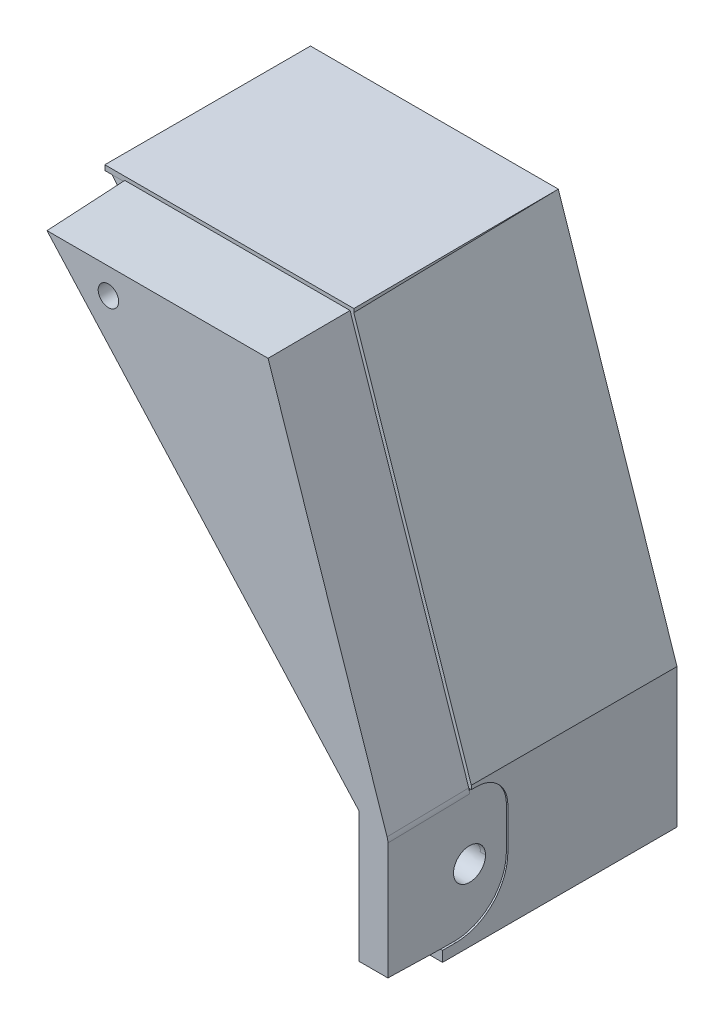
ISO-10303-21;
HEADER;
FILE_DESCRIPTION(('STEP AP214'),'2;1');
FILE_NAME('part.step','',(''),(''),'','','');
FILE_SCHEMA(('AUTOMOTIVE_DESIGN { 1 0 10303 214 1 1 1 1 }'));
ENDSEC;
DATA;
#1=APPLICATION_CONTEXT('core data for automotive mechanical design processes');
#2=APPLICATION_PROTOCOL_DEFINITION('international standard','automotive_design',2000,#1);
#3=PRODUCT_CONTEXT('',#1,'mechanical');
#4=PRODUCT('Part','Part','',(#3));
#5=PRODUCT_RELATED_PRODUCT_CATEGORY('part','',(#4));
#6=PRODUCT_DEFINITION_FORMATION('','',#4);
#7=PRODUCT_DEFINITION_CONTEXT('part definition',#1,'design');
#8=PRODUCT_DEFINITION('design','',#6,#7);
#9=PRODUCT_DEFINITION_SHAPE('','',#8);
#10=(LENGTH_UNIT() NAMED_UNIT(*) SI_UNIT(.MILLI.,.METRE.));
#11=(NAMED_UNIT(*) PLANE_ANGLE_UNIT() SI_UNIT($,.RADIAN.));
#12=(NAMED_UNIT(*) SI_UNIT($,.STERADIAN.) SOLID_ANGLE_UNIT());
#13=UNCERTAINTY_MEASURE_WITH_UNIT(LENGTH_MEASURE(1.E-05),#10,'distance_accuracy_value','');
#14=(GEOMETRIC_REPRESENTATION_CONTEXT(3) GLOBAL_UNCERTAINTY_ASSIGNED_CONTEXT((#13)) GLOBAL_UNIT_ASSIGNED_CONTEXT((#10,
#11,#12)) REPRESENTATION_CONTEXT('',''));
#15=CARTESIAN_POINT('',(0.,0.,0.));
#16=DIRECTION('',(0.,0.,1.));
#17=DIRECTION('',(1.,0.,0.));
#18=AXIS2_PLACEMENT_3D('',#15,#16,#17);
#19=CARTESIAN_POINT('',(-16.8175702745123,-44.115,-12.7197076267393));
#20=DIRECTION('',(-0.999961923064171,0.,-0.00872653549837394));
#21=DIRECTION('',(0.00872653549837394,1.16435511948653E-13,-0.999961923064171));
#22=AXIS2_PLACEMENT_3D('',#19,#20,#21);
#23=ELLIPSE('',#22,10.2003883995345,10.2);
#24=DIRECTION('',(-0.999961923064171,0.,-0.00872653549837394));
#25=VECTOR('',#24,1.);
#26=SURFACE_OF_LINEAR_EXTRUSION('',#23,#25);
#27=DIRECTION('',(-1.,0.,0.));
#28=VECTOR('',#27,1.);
#29=CARTESIAN_POINT('',(-17.544,-54.315,-12.75));
#30=LINE('',#29,#28);
#31=CARTESIAN_POINT('',(-20.2887324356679,-54.315,-12.75));
#32=VERTEX_POINT('',#31);
#33=CARTESIAN_POINT('',(-19.9112954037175,-54.315,-12.75));
#34=VERTEX_POINT('',#33);
#35=EDGE_CURVE('E576',#32,#34,#30,.F.);
#36=ORIENTED_EDGE('',*,*,#35,.F.);
#37=DIRECTION('',(-0.999961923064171,0.,-0.00872653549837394));
#38=VECTOR('',#37,1.);
#39=CARTESIAN_POINT('',(-16.8175702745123,-54.315,-12.7197076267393));
#40=LINE('',#39,#38);
#41=CARTESIAN_POINT('',(-19.9112954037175,-54.315,-12.7467061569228));
#42=VERTEX_POINT('',#41);
#43=EDGE_CURVE('E274',#42,#32,#40,.T.);
#44=ORIENTED_EDGE('',*,*,#43,.F.);
#45=CARTESIAN_POINT('',(-19.9112954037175,-54.315,-12.7467061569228));
#46=CARTESIAN_POINT('',(-19.9112954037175,-54.315000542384,-12.8512262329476));
#47=CARTESIAN_POINT('',(-19.9112954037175,-54.3133937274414,-12.9557462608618));
#48=CARTESIAN_POINT('',(-19.9112954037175,-54.306981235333,-13.1642990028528));
#49=CARTESIAN_POINT('',(-19.9112954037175,-54.3021874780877,-13.2683320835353));
#50=CARTESIAN_POINT('',(-19.9112954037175,-54.2894346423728,-13.4759131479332));
#51=CARTESIAN_POINT('',(-19.9112954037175,-54.281484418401,-13.5794616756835));
#52=CARTESIAN_POINT('',(-19.9112954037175,-54.2624438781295,-13.7860753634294));
#53=CARTESIAN_POINT('',(-19.9112954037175,-54.2513594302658,-13.8891410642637));
#54=CARTESIAN_POINT('',(-19.9112954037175,-54.2260665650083,-14.0947903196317));
#55=CARTESIAN_POINT('',(-19.9112954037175,-54.2118610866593,-14.1973742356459));
#56=CARTESIAN_POINT('',(-19.9112954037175,-54.1803333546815,-14.4020619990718));
#57=CARTESIAN_POINT('',(-19.9112954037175,-54.1630111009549,-14.5041658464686));
#58=CARTESIAN_POINT('',(-19.9112954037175,-54.1252481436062,-14.7078943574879));
#59=CARTESIAN_POINT('',(-19.9112954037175,-54.1048045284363,-14.8095184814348));
#60=CARTESIAN_POINT('',(-19.9112954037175,-54.0607887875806,-15.0122852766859));
#61=CARTESIAN_POINT('',(-19.9112954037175,-54.0372109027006,-15.1134266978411));
#62=CARTESIAN_POINT('',(-19.9112954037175,-53.9869077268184,-15.3152239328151));
#63=CARTESIAN_POINT('',(-19.9112954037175,-53.9601738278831,-15.415877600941));
#64=CARTESIAN_POINT('',(-19.9112954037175,-53.9035316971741,-15.6166935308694));
#65=CARTESIAN_POINT('',(-19.9112954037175,-53.8736119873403,-15.7168525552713));
#66=CARTESIAN_POINT('',(-19.9112954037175,-53.8421593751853,-15.8165279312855));
#67=B_SPLINE_CURVE_WITH_KNOTS('',3,(#45,#46,#47,#48,#49,#50,#51,#52,#53,#54,#55,#56,#57,#58,#59,
#60,#61,#62,#63,#64,#65,#66),.UNSPECIFIED.,.F.,.F.,(4,2,2,2,2,2,2,2,2,2,4),(0.,
0.313547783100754,0.625929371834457,0.937440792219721,1.24837276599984,1.5590131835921,
1.86965361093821,2.18058558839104,2.4920970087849,2.80447859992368,3.11802639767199),.UNSPECIFIED.);
#68=EDGE_CURVE('E662',#42,#34,#67,.T.);
#69=ORIENTED_EDGE('',*,*,#68,.T.);
#70=EDGE_LOOP('',(#36,#44,#69));
#71=FACE_BOUND('',#70,.T.);
#72=ADVANCED_FACE('F36',(#71),#26,.F.);
#73=CARTESIAN_POINT('',(-20.4,-29.937,0.));
#74=DIRECTION('',(-0.999961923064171,0.,-0.00872653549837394));
#75=DIRECTION('',(-0.00872653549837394,0.,0.999961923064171));
#76=AXIS2_PLACEMENT_3D('',#73,#74,#75);
#77=PLANE('',#76);
#78=CARTESIAN_POINT('',(-20.262028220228,-42.687,-15.81));
#79=DIRECTION('',(-0.999961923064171,0.,-0.00872653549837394));
#80=DIRECTION('',(0.00872653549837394,1.16435511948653E-13,-0.999961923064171));
#81=AXIS2_PLACEMENT_3D('',#78,#79,#80);
#82=ELLIPSE('',#81,3.10011804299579,3.1);
#83=CARTESIAN_POINT('',(-20.2890814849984,-42.6912464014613,-12.7100029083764));
#84=VERTEX_POINT('',#83);
#85=CARTESIAN_POINT('',(-20.2349749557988,-42.6912748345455,-18.9099970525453));
#86=VERTEX_POINT('',#85);
#87=EDGE_CURVE('E58',#84,#86,#82,.T.);
#88=ORIENTED_EDGE('',*,*,#87,.T.);
#89=CARTESIAN_POINT('',(-20.2474065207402,-40.0873228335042,-17.4854808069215));
#90=CARTESIAN_POINT('',(-20.2467662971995,-40.1344406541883,-17.5588431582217));
#91=CARTESIAN_POINT('',(-20.2461435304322,-40.1846652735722,-17.6302051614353));
#92=CARTESIAN_POINT('',(-20.2449371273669,-40.2909409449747,-17.7684452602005));
#93=CARTESIAN_POINT('',(-20.2443534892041,-40.3469917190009,-17.8353235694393));
#94=CARTESIAN_POINT('',(-20.2432298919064,-40.4644959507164,-17.964075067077));
#95=CARTESIAN_POINT('',(-20.242689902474,-40.5259455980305,-18.0259517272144));
#96=CARTESIAN_POINT('',(-20.2416570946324,-40.6538145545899,-18.1442997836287));
#97=CARTESIAN_POINT('',(-20.2411642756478,-40.7202338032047,-18.2007712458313));
#98=CARTESIAN_POINT('',(-20.2397615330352,-40.9263365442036,-18.3615096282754));
#99=CARTESIAN_POINT('',(-20.2389268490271,-41.0729147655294,-18.4571549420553));
#100=CARTESIAN_POINT('',(-20.2374847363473,-41.3799423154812,-18.6224046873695));
#101=CARTESIAN_POINT('',(-20.2368772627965,-41.5403888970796,-18.6920142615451));
#102=CARTESIAN_POINT('',(-20.2359058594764,-41.870711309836,-18.8033260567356));
#103=CARTESIAN_POINT('',(-20.2355419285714,-42.0405870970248,-18.8450284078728));
#104=CARTESIAN_POINT('',(-20.2350680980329,-42.38494978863,-18.8993240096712));
#105=CARTESIAN_POINT('',(-20.2349582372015,-42.5594373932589,-18.9119128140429));
#106=CARTESIAN_POINT('',(-20.234995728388,-42.9080373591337,-18.9076167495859));
#107=CARTESIAN_POINT('',(-20.2351430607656,-43.0821497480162,-18.8907341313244));
#108=CARTESIAN_POINT('',(-20.2356907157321,-43.4250579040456,-18.8279790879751));
#109=CARTESIAN_POINT('',(-20.2360910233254,-43.5938539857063,-18.7821083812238));
#110=CARTESIAN_POINT('',(-20.2371332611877,-43.9213542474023,-18.6626797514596));
#111=CARTESIAN_POINT('',(-20.2377751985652,-44.080058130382,-18.5891210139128));
#112=CARTESIAN_POINT('',(-20.2392824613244,-44.382860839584,-18.416405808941));
#113=CARTESIAN_POINT('',(-20.2401477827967,-44.5269599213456,-18.3172497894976));
#114=CARTESIAN_POINT('',(-20.2420771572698,-44.7964547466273,-18.096165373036));
#115=CARTESIAN_POINT('',(-20.2431411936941,-44.9218520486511,-17.9742388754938));
#116=CARTESIAN_POINT('',(-20.245438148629,-45.1504247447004,-17.7110339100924));
#117=CARTESIAN_POINT('',(-20.2466711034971,-45.2535953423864,-17.5697512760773));
#118=CARTESIAN_POINT('',(-20.2492710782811,-45.4347889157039,-17.2718236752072));
#119=CARTESIAN_POINT('',(-20.2506381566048,-45.5128008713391,-17.1151720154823));
#120=CARTESIAN_POINT('',(-20.2534663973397,-45.641342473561,-16.7910877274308));
#121=CARTESIAN_POINT('',(-20.2549274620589,-45.6919001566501,-16.6236662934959));
#122=CARTESIAN_POINT('',(-20.2573230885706,-45.7501459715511,-16.3491546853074));
#123=CARTESIAN_POINT('',(-20.2582416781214,-45.7668581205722,-16.2438947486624));
#124=CARTESIAN_POINT('',(-20.2600881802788,-45.7893735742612,-16.0323065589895));
#125=CARTESIAN_POINT('',(-20.2610160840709,-45.7951863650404,-15.9259793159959));
#126=CARTESIAN_POINT('',(-20.263443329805,-45.7960322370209,-15.6478445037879));
#127=CARTESIAN_POINT('',(-20.2649435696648,-45.7822504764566,-15.4759340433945));
#128=CARTESIAN_POINT('',(-20.2679028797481,-45.7264260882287,-15.1368306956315));
#129=CARTESIAN_POINT('',(-20.2693619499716,-45.6843834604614,-14.9696378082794));
#130=CARTESIAN_POINT('',(-20.2721993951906,-45.5732058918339,-14.6444987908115));
#131=CARTESIAN_POINT('',(-20.2735777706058,-45.5040710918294,-14.4865526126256));
#132=CARTESIAN_POINT('',(-20.2762156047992,-45.340614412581,-14.1842867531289));
#133=CARTESIAN_POINT('',(-20.2774750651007,-45.2462928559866,-14.0399668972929));
#134=CARTESIAN_POINT('',(-20.2798403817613,-45.035065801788,-13.7689284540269));
#135=CARTESIAN_POINT('',(-20.2809462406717,-44.9181606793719,-13.6422095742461));
#136=CARTESIAN_POINT('',(-20.2829738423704,-44.6649916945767,-13.4098694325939));
#137=CARTESIAN_POINT('',(-20.2838955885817,-44.5287281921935,-13.3042477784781));
#138=CARTESIAN_POINT('',(-20.285529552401,-44.2406015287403,-13.1170140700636));
#139=CARTESIAN_POINT('',(-20.2862417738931,-44.0887386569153,-13.0354015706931));
#140=CARTESIAN_POINT('',(-20.2874370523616,-43.773602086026,-12.8984362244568));
#141=CARTESIAN_POINT('',(-20.2879201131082,-43.6103285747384,-12.8430829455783));
#142=CARTESIAN_POINT('',(-20.2886437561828,-43.2768737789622,-12.7601616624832));
#143=CARTESIAN_POINT('',(-20.2888843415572,-43.1066925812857,-12.7325933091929));
#144=CARTESIAN_POINT('',(-20.2891164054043,-42.7641155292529,-12.7060014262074));
#145=CARTESIAN_POINT('',(-20.2891078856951,-42.591719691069,-12.706977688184));
#146=CARTESIAN_POINT('',(-20.2888419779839,-42.2494672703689,-12.7374476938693));
#147=CARTESIAN_POINT('',(-20.2885845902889,-42.0796106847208,-12.7669414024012));
#148=CARTESIAN_POINT('',(-20.2878280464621,-41.7471214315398,-12.8536327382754));
#149=CARTESIAN_POINT('',(-20.287328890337,-41.584488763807,-12.9108303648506));
#150=CARTESIAN_POINT('',(-20.2861025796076,-41.2709328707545,-13.0513516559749));
#151=CARTESIAN_POINT('',(-20.2853754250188,-41.1200096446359,-13.1346753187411));
#152=CARTESIAN_POINT('',(-20.2837131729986,-40.8340349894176,-13.3251505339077));
#153=CARTESIAN_POINT('',(-20.2827780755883,-40.6989835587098,-13.4323020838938));
#154=CARTESIAN_POINT('',(-20.2807257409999,-40.4484768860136,-13.6674763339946));
#155=CARTESIAN_POINT('',(-20.2796085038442,-40.3330216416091,-13.795499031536));
#156=CARTESIAN_POINT('',(-20.2772226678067,-40.1248909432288,-14.068888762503));
#157=CARTESIAN_POINT('',(-20.2759540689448,-40.0322154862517,-14.2142557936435));
#158=CARTESIAN_POINT('',(-20.2733006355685,-39.8721999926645,-14.5183091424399));
#159=CARTESIAN_POINT('',(-20.2719158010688,-39.8048599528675,-14.6769954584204));
#160=CARTESIAN_POINT('',(-20.2691334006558,-39.6998550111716,-14.9958269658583));
#161=CARTESIAN_POINT('',(-20.2677393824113,-39.660962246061,-15.1555656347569));
#162=CARTESIAN_POINT('',(-20.2656063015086,-39.6216012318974,-15.3999924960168));
#163=CARTESIAN_POINT('',(-20.2648797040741,-39.6116438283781,-15.4832523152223));
#164=CARTESIAN_POINT('',(-20.2634170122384,-39.5984559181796,-15.6508601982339));
#165=CARTESIAN_POINT('',(-20.262680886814,-39.5952705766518,-15.7352118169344));
#166=CARTESIAN_POINT('',(-20.2619445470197,-39.5955327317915,-15.819588));
#167=B_SPLINE_CURVE_WITH_KNOTS('',3,(#89,#90,#91,#92,#93,#94,#95,#96,#97,#98,#99,#100,#101,#102,
#103,#104,#105,#106,#107,#108,#109,#110,#111,#112,#113,#114,#115,#116,#117,#118,#119,#120,#121,
#122,#123,#124,#125,#126,#127,#128,#129,#130,#131,#132,#133,#134,#135,#136,#137,#138,#139,#140,
#141,#142,#143,#144,#145,#146,#147,#148,#149,#150,#151,#152,#153,#154,#155,#156,#157,#158,#159,
#160,#161,#162,#163,#164,#165,#166),.UNSPECIFIED.,.F.,.F.,(4,2,2,2,2,2,2,2,2,2,2,2,2,2,2,2,2,2,
2,2,2,2,2,2,2,2,2,2,2,2,2,2,2,2,2,2,2,2,4),(0.,0.261492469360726,0.522972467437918,
0.784269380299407,1.04556310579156,1.56793222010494,2.09019810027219,2.61246154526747,
3.13480474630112,3.65710806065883,4.17938041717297,4.70166813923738,5.22394672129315,
5.74618175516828,6.26852937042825,6.79110547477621,7.31314691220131,7.63237795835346,
7.95133103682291,8.46620498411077,8.98107893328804,9.49595020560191,10.0108148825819,
10.5256710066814,11.040517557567,11.5553545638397,12.0701830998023,12.5850051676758,
13.099823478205,13.6146411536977,14.1294588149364,14.6442764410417,15.1590940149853,
15.6739115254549,16.1887289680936,16.7035463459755,17.1945658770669,17.4458938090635,
17.6988927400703),.UNSPECIFIED.);
#168=EDGE_CURVE('E327',#86,#84,#167,.T.);
#169=ORIENTED_EDGE('',*,*,#168,.T.);
#170=EDGE_LOOP('',(#88,#169));
#171=FACE_BOUND('',#170,.T.);
#172=DIRECTION('',(-0.00872289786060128,-0.028870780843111,0.99954509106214));
#173=VECTOR('',#172,1.);
#174=CARTESIAN_POINT('',(-20.2618211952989,-30.8382162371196,-15.8337227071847));
#175=LINE('',#174,#173);
#176=CARTESIAN_POINT('',(-20.4,-31.2955562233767,0.));
#177=VERTEX_POINT('',#176);
#178=CARTESIAN_POINT('',(-20.2619445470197,-30.8386245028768,-15.819588));
#179=VERTEX_POINT('',#178);
#180=EDGE_CURVE('E616',#177,#179,#175,.F.);
#181=ORIENTED_EDGE('',*,*,#180,.F.);
#182=DIRECTION('',(0.,-1.,0.));
#183=VECTOR('',#182,1.);
#184=CARTESIAN_POINT('',(-20.4,-29.937,0.));
#185=LINE('',#184,#183);
#186=CARTESIAN_POINT('',(-20.4,-54.1369583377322,0.));
#187=VERTEX_POINT('',#186);
#188=EDGE_CURVE('E281',#177,#187,#185,.T.);
#189=ORIENTED_EDGE('',*,*,#188,.T.);
#190=DIRECTION('',(0.00872520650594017,-0.0174517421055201,-0.999809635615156));
#191=VECTOR('',#190,1.);
#192=CARTESIAN_POINT('',(-20.4036849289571,-54.1295879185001,0.422251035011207));
#193=LINE('',#192,#191);
#194=CARTESIAN_POINT('',(-20.3109859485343,-54.315,-10.2));
#195=VERTEX_POINT('',#194);
#196=EDGE_CURVE('E439',#195,#187,#193,.F.);
#197=ORIENTED_EDGE('',*,*,#196,.F.);
#198=DIRECTION('',(-0.00872653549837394,0.,0.999961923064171));
#199=VECTOR('',#198,1.);
#200=CARTESIAN_POINT('',(-20.4,-54.315,0.));
#201=LINE('',#200,#199);
#202=EDGE_CURVE('E267',#32,#195,#201,.T.);
#203=ORIENTED_EDGE('',*,*,#202,.F.);
#204=CARTESIAN_POINT('',(-20.2887324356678,-44.115,-12.75));
#205=DIRECTION('',(-0.999961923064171,0.,-0.00872653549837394));
#206=DIRECTION('',(0.00872653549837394,1.16435511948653E-13,-0.999961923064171));
#207=AXIS2_PLACEMENT_3D('',#204,#205,#206);
#208=ELLIPSE('',#207,10.2003883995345,10.2);
#209=CARTESIAN_POINT('',(-20.1997183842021,-44.115,-22.95));
#210=VERTEX_POINT('',#209);
#211=EDGE_CURVE('E270',#210,#32,#208,.T.);
#212=ORIENTED_EDGE('',*,*,#211,.F.);
#213=DIRECTION('',(0.,1.,0.));
#214=VECTOR('',#213,1.);
#215=CARTESIAN_POINT('',(-20.199718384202,-29.937,-22.95));
#216=LINE('',#215,#214);
#217=CARTESIAN_POINT('',(-20.199718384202,-36.057,-22.95));
#218=VERTEX_POINT('',#217);
#219=EDGE_CURVE('E571',#210,#218,#216,.T.);
#220=ORIENTED_EDGE('',*,*,#219,.T.);
#221=CARTESIAN_POINT('',(-20.2531268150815,-36.057,-16.83));
#222=DIRECTION('',(-0.999961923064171,0.,-0.00872653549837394));
#223=DIRECTION('',(-0.00872653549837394,-1.16435511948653E-13,0.999961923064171));
#224=AXIS2_PLACEMENT_3D('',#221,#222,#223);
#225=ELLIPSE('',#224,6.12023303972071,6.12);
#226=CARTESIAN_POINT('',(-20.2531268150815,-29.937,-16.83));
#227=VERTEX_POINT('',#226);
#228=EDGE_CURVE('E575',#227,#218,#225,.T.);
#229=ORIENTED_EDGE('',*,*,#228,.F.);
#230=DIRECTION('',(-0.00872653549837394,0.,0.999961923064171));
#231=VECTOR('',#230,1.);
#232=CARTESIAN_POINT('',(-18.4171455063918,-29.937,-227.212619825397));
#233=LINE('',#232,#231);
#234=CARTESIAN_POINT('',(-20.2619445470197,-29.937,-15.819588));
#235=VERTEX_POINT('',#234);
#236=EDGE_CURVE('E573',#227,#235,#233,.T.);
#237=ORIENTED_EDGE('',*,*,#236,.T.);
#238=DIRECTION('',(0.,-1.,0.));
#239=VECTOR('',#238,1.);
#240=CARTESIAN_POINT('',(-20.2619445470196,39.015,-15.819588));
#241=LINE('',#240,#239);
#242=EDGE_CURVE('E563',#235,#179,#241,.T.);
#243=ORIENTED_EDGE('',*,*,#242,.T.);
#244=EDGE_LOOP('',(#181,#189,#197,#203,#212,#220,#229,#237,#243));
#245=FACE_BOUND('',#244,.T.);
#246=ADVANCED_FACE('F241',(#171,#245),#77,.F.);
#247=CARTESIAN_POINT('',(5.049,-56.355,-10.2));
#248=DIRECTION('',(0.,-1.,0.));
#249=DIRECTION('',(1.,0.,0.));
#250=AXIS2_PLACEMENT_3D('',#247,#248,#249);
#251=PLANE('',#250);
#252=DIRECTION('',(0.,0.,-1.));
#253=VECTOR('',#252,1.);
#254=CARTESIAN_POINT('',(-19.9112954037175,-56.355,-56.));
#255=LINE('',#254,#253);
#256=CARTESIAN_POINT('',(-19.9112954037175,-56.355,-10.2));
#257=VERTEX_POINT('',#256);
#258=CARTESIAN_POINT('',(-19.9112954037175,-56.355,-56.));
#259=VERTEX_POINT('',#258);
#260=EDGE_CURVE('E498',#257,#259,#255,.T.);
#261=ORIENTED_EDGE('',*,*,#260,.F.);
#262=DIRECTION('',(1.,0.,0.));
#263=VECTOR('',#262,1.);
#264=CARTESIAN_POINT('',(5.049,-56.355,-10.2));
#265=LINE('',#264,#263);
#266=CARTESIAN_POINT('',(-28.3813369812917,-56.355,-10.2));
#267=VERTEX_POINT('',#266);
#268=EDGE_CURVE('E51',#267,#257,#265,.T.);
#269=ORIENTED_EDGE('',*,*,#268,.F.);
#270=DIRECTION('',(0.,0.,1.));
#271=VECTOR('',#270,1.);
#272=CARTESIAN_POINT('',(-28.3813369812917,-56.355,-210.2));
#273=LINE('',#272,#271);
#274=CARTESIAN_POINT('',(-28.3813369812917,-56.355,-56.));
#275=VERTEX_POINT('',#274);
#276=EDGE_CURVE('E449',#275,#267,#273,.T.);
#277=ORIENTED_EDGE('',*,*,#276,.F.);
#278=DIRECTION('',(-1.,0.,0.));
#279=VECTOR('',#278,1.);
#280=CARTESIAN_POINT('',(5.049,-56.355,-56.));
#281=LINE('',#280,#279);
#282=EDGE_CURVE('E500',#275,#259,#281,.F.);
#283=ORIENTED_EDGE('',*,*,#282,.T.);
#284=EDGE_LOOP('',(#261,#269,#277,#283));
#285=FACE_BOUND('',#284,.T.);
#286=ADVANCED_FACE('F247',(#285),#251,.T.);
#287=CARTESIAN_POINT('',(-65.6145427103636,39.9924836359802,-56.));
#288=DIRECTION('',(0.,-1.,0.));
#289=DIRECTION('',(1.,0.,0.));
#290=AXIS2_PLACEMENT_3D('',#287,#288,#289);
#291=PLANE('',#290);
#292=DIRECTION('',(0.,0.,-1.));
#293=VECTOR('',#292,1.);
#294=CARTESIAN_POINT('',(-91.5238680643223,39.9924836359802,-61.5319262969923));
#295=LINE('',#294,#293);
#296=CARTESIAN_POINT('',(-91.5238680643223,39.9924906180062,-56.));
#297=VERTEX_POINT('',#296);
#298=CARTESIAN_POINT('',(-91.5238680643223,39.9924836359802,-15.819588));
#299=VERTEX_POINT('',#298);
#300=EDGE_CURVE('E353',#297,#299,#295,.F.);
#301=ORIENTED_EDGE('',*,*,#300,.T.);
#302=DIRECTION('',(-1.,0.,0.));
#303=VECTOR('',#302,1.);
#304=CARTESIAN_POINT('',(-65.6145427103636,39.9924836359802,-15.819588));
#305=LINE('',#304,#303);
#306=CARTESIAN_POINT('',(-42.8680780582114,39.9924871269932,-15.819588));
#307=VERTEX_POINT('',#306);
#308=EDGE_CURVE('E598',#299,#307,#305,.F.);
#309=ORIENTED_EDGE('',*,*,#308,.T.);
#310=DIRECTION('',(-0.00584967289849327,0.,-0.999982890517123));
#311=VECTOR('',#310,1.);
#312=CARTESIAN_POINT('',(-42.7762268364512,39.9924836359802,-0.117915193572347));
#313=LINE('',#312,#311);
#314=CARTESIAN_POINT('',(-43.1031230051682,39.9924871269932,-56.));
#315=VERTEX_POINT('',#314);
#316=EDGE_CURVE('E351',#315,#307,#313,.F.);
#317=ORIENTED_EDGE('',*,*,#316,.F.);
#318=DIRECTION('',(-1.,0.,0.));
#319=VECTOR('',#318,1.);
#320=CARTESIAN_POINT('',(-91.8,39.9924836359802,-56.));
#321=LINE('',#320,#319);
#322=EDGE_CURVE('E665',#315,#297,#321,.T.);
#323=ORIENTED_EDGE('',*,*,#322,.T.);
#324=EDGE_LOOP('',(#301,#309,#317,#323));
#325=FACE_BOUND('',#324,.T.);
#326=ADVANCED_FACE('F488',(#325),#291,.F.);
#327=CARTESIAN_POINT('',(-42.7771153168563,48.6941461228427,-0.117909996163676));
#328=DIRECTION('',(0.999982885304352,0.000102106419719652,-0.00584967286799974));
#329=DIRECTION('',(-0.00584967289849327,0.,-0.999982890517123));
#330=AXIS2_PLACEMENT_3D('',#327,#328,#329);
#331=PLANE('',#330);
#332=ORIENTED_EDGE('',*,*,#316,.T.);
#333=DIRECTION('',(0.000102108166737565,-0.999999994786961,0.));
#334=VECTOR('',#333,1.);
#335=CARTESIAN_POINT('',(-42.868966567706,48.6941367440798,-15.819588));
#336=LINE('',#335,#334);
#337=CARTESIAN_POINT('',(-42.8680064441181,39.2911319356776,-15.819588));
#338=VERTEX_POINT('',#337);
#339=EDGE_CURVE('E596',#307,#338,#336,.T.);
#340=ORIENTED_EDGE('',*,*,#339,.T.);
#341=DIRECTION('',(0.00585056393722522,-0.017452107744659,0.999830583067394));
#342=VECTOR('',#341,1.);
#343=CARTESIAN_POINT('',(-42.7771153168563,39.0200056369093,-0.286772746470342));
#344=LINE('',#343,#342);
#345=EDGE_CURVE('E676',#315,#338,#344,.T.);
#346=ORIENTED_EDGE('',*,*,#345,.F.);
#347=EDGE_LOOP('',(#332,#340,#346));
#348=FACE_BOUND('',#347,.T.);
#349=ADVANCED_FACE('F493',(#348),#331,.T.);
#350=CARTESIAN_POINT('',(-26.01,-28.722549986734,0.));
#351=DIRECTION('',(0.999847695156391,0.,-0.0174524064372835));
#352=DIRECTION('',(-0.0174524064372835,0.,-0.999847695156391));
#353=AXIS2_PLACEMENT_3D('',#350,#351,#352);
#354=PLANE('',#353);
#355=DIRECTION('',(0.,1.,0.));
#356=VECTOR('',#355,1.);
#357=CARTESIAN_POINT('',(-26.01,-28.722549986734,0.));
#358=LINE('',#357,#356);
#359=CARTESIAN_POINT('',(-26.01,-28.7225499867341,0.));
#360=VERTEX_POINT('',#359);
#361=CARTESIAN_POINT('',(-26.01,-54.1369583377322,0.));
#362=VERTEX_POINT('',#361);
#363=EDGE_CURVE('E450',#360,#362,#358,.F.);
#364=ORIENTED_EDGE('',*,*,#363,.F.);
#365=DIRECTION('',(0.01745201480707,0.00669920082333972,0.999825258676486));
#366=VECTOR('',#365,1.);
#367=CARTESIAN_POINT('',(-26.01,-28.722549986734,0.));
#368=LINE('',#367,#366);
#369=CARTESIAN_POINT('',(-26.2148568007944,-28.8011871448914,-11.7362382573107));
#370=VERTEX_POINT('',#369);
#371=EDGE_CURVE('E564',#370,#360,#368,.T.);
#372=ORIENTED_EDGE('',*,*,#371,.F.);
#373=DIRECTION('',(0.00104910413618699,-0.998191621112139,0.0601031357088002));
#374=VECTOR('',#373,1.);
#375=CARTESIAN_POINT('',(-26.2141989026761,-29.4271577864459,-11.698547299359));
#376=LINE('',#375,#374);
#377=CARTESIAN_POINT('',(-26.1880416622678,-54.315,-10.2));
#378=VERTEX_POINT('',#377);
#379=EDGE_CURVE('E453',#378,#370,#376,.F.);
#380=ORIENTED_EDGE('',*,*,#379,.F.);
#381=DIRECTION('',(0.0174497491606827,0.0174497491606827,0.999695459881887));
#382=VECTOR('',#381,1.);
#383=CARTESIAN_POINT('',(-26.0022614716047,-54.1292198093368,0.443339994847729));
#384=LINE('',#383,#382);
#385=EDGE_CURVE('E442',#378,#362,#384,.T.);
#386=ORIENTED_EDGE('',*,*,#385,.T.);
#387=EDGE_LOOP('',(#364,#372,#380,#386));
#388=FACE_BOUND('',#387,.T.);
#389=ADVANCED_FACE('F645',(#388),#354,.F.);
#390=CARTESIAN_POINT('',(5.049,41.565,-10.2));
#391=DIRECTION('',(0.,0.,-1.));
#392=DIRECTION('',(-1.,0.,0.));
#393=AXIS2_PLACEMENT_3D('',#390,#391,#392);
#394=PLANE('',#393);
#395=DIRECTION('',(-0.000304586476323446,0.999999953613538,0.));
#396=VECTOR('',#395,1.);
#397=CARTESIAN_POINT('',(-28.4111589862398,41.5548084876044,-10.2));
#398=LINE('',#397,#396);
#399=CARTESIAN_POINT('',(-28.3819583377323,-54.315,-10.2));
#400=VERTEX_POINT('',#399);
#401=EDGE_CURVE('E384',#267,#400,#398,.T.);
#402=ORIENTED_EDGE('',*,*,#401,.F.);
#403=ORIENTED_EDGE('',*,*,#268,.T.);
#404=DIRECTION('',(0.,1.,0.));
#405=VECTOR('',#404,1.);
#406=CARTESIAN_POINT('',(-19.9112954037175,-29.937,-10.2));
#407=LINE('',#406,#405);
#408=CARTESIAN_POINT('',(-19.9112954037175,-54.315,-10.2));
#409=VERTEX_POINT('',#408);
#410=EDGE_CURVE('E412',#409,#257,#407,.F.);
#411=ORIENTED_EDGE('',*,*,#410,.F.);
#412=DIRECTION('',(1.,0.,0.));
#413=VECTOR('',#412,1.);
#414=CARTESIAN_POINT('',(-30.6,-54.315,-10.2));
#415=LINE('',#414,#413);
#416=EDGE_CURVE('E560',#195,#409,#415,.T.);
#417=ORIENTED_EDGE('',*,*,#416,.F.);
#418=DIRECTION('',(1.,0.,0.));
#419=VECTOR('',#418,1.);
#420=CARTESIAN_POINT('',(-30.6,-54.315,-10.2));
#421=LINE('',#420,#419);
#422=EDGE_CURVE('E282',#378,#195,#421,.T.);
#423=ORIENTED_EDGE('',*,*,#422,.F.);
#424=DIRECTION('',(-1.,0.,0.));
#425=VECTOR('',#424,1.);
#426=CARTESIAN_POINT('',(538.56,-54.315,-10.2000000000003));
#427=LINE('',#426,#425);
#428=EDGE_CURVE('E377',#378,#400,#427,.T.);
#429=ORIENTED_EDGE('',*,*,#428,.T.);
#430=EDGE_LOOP('',(#402,#403,#411,#417,#423,#429));
#431=FACE_BOUND('',#430,.T.);
#432=ADVANCED_FACE('F657',(#431),#394,.F.);
#433=CARTESIAN_POINT('',(-30.6,-54.315,-10.2));
#434=DIRECTION('',(0.,0.999847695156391,-0.0174524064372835));
#435=DIRECTION('',(0.,0.0174524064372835,0.999847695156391));
#436=AXIS2_PLACEMENT_3D('',#433,#434,#435);
#437=PLANE('',#436);
#438=ORIENTED_EDGE('',*,*,#196,.T.);
#439=DIRECTION('',(-1.,0.,0.));
#440=VECTOR('',#439,1.);
#441=CARTESIAN_POINT('',(-30.6,-54.1369583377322,0.));
#442=LINE('',#441,#440);
#443=EDGE_CURVE('E446',#362,#187,#442,.F.);
#444=ORIENTED_EDGE('',*,*,#443,.F.);
#445=ORIENTED_EDGE('',*,*,#385,.F.);
#446=ORIENTED_EDGE('',*,*,#422,.T.);
#447=EDGE_LOOP('',(#438,#444,#445,#446));
#448=FACE_BOUND('',#447,.T.);
#449=ADVANCED_FACE('F485',(#448),#437,.F.);
#450=CARTESIAN_POINT('',(-91.8,64.515,0.));
#451=DIRECTION('',(0.,0.,1.));
#452=DIRECTION('',(1.,0.,0.));
#453=AXIS2_PLACEMENT_3D('',#450,#451,#452);
#454=PLANE('',#453);
#455=CARTESIAN_POINT('',(-23.4001142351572,-31.2963123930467,0.));
#456=DIRECTION('',(0.,0.,1.));
#457=DIRECTION('',(0.289223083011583,0.95726172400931,0.));
#458=AXIS2_PLACEMENT_3D('',#455,#456,#457);
#459=ELLIPSE('',#458,3.00136534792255,3.);
#460=CARTESIAN_POINT('',(-20.5556678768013,-30.341394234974,0.));
#461=VERTEX_POINT('',#460);
#462=EDGE_CURVE('E623',#461,#177,#459,.F.);
#463=ORIENTED_EDGE('',*,*,#462,.F.);
#464=DIRECTION('',(0.317850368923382,-0.948140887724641,0.));
#465=VECTOR('',#464,1.);
#466=CARTESIAN_POINT('',(-44.6318119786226,41.4772313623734,0.));
#467=LINE('',#466,#465);
#468=CARTESIAN_POINT('',(-43.8063849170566,39.015,0.));
#469=VERTEX_POINT('',#468);
#470=EDGE_CURVE('E380',#469,#461,#467,.T.);
#471=ORIENTED_EDGE('',*,*,#470,.F.);
#472=DIRECTION('',(1.,0.,0.));
#473=VECTOR('',#472,1.);
#474=CARTESIAN_POINT('',(-91.8,39.015,0.));
#475=LINE('',#474,#473);
#476=CARTESIAN_POINT('',(-87.0011639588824,39.015,0.));
#477=VERTEX_POINT('',#476);
#478=EDGE_CURVE('E396',#477,#469,#475,.T.);
#479=ORIENTED_EDGE('',*,*,#478,.F.);
#480=DIRECTION('',(0.669130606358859,-0.743144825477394,0.));
#481=VECTOR('',#480,1.);
#482=CARTESIAN_POINT('',(-87.0011639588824,39.015,0.));
#483=LINE('',#482,#481);
#484=EDGE_CURVE('E400',#477,#360,#483,.T.);
#485=ORIENTED_EDGE('',*,*,#484,.T.);
#486=ORIENTED_EDGE('',*,*,#363,.T.);
#487=ORIENTED_EDGE('',*,*,#443,.T.);
#488=ORIENTED_EDGE('',*,*,#188,.F.);
#489=EDGE_LOOP('',(#463,#471,#479,#485,#486,#487,#488));
#490=FACE_BOUND('',#489,.T.);
#491=CARTESIAN_POINT('',(-74.9999919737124,33.9924836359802,0.));
#492=DIRECTION('',(0.,0.,1.));
#493=DIRECTION('',(1.,0.,0.));
#494=AXIS2_PLACEMENT_3D('',#491,#492,#493);
#495=CIRCLE('',#494,2.);
#496=CARTESIAN_POINT('',(-72.9999919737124,33.9924836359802,0.));
#497=VERTEX_POINT('',#496);
#498=EDGE_CURVE('E550',#497,#497,#495,.T.);
#499=ORIENTED_EDGE('',*,*,#498,.F.);
#500=EDGE_LOOP('',(#499));
#501=FACE_BOUND('',#500,.T.);
#502=ADVANCED_FACE('F482',(#490,#501),#454,.T.);
#503=CARTESIAN_POINT('',(538.56,-54.315,-10.2000000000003));
#504=DIRECTION('',(0.,0.0601031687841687,0.998192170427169));
#505=DIRECTION('',(0.,-0.998192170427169,0.0601031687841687));
#506=AXIS2_PLACEMENT_3D('',#503,#504,#505);
#507=PLANE('',#506);
#508=ORIENTED_EDGE('',*,*,#379,.T.);
#509=DIRECTION('',(0.669041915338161,-0.741881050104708,0.0446701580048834));
#510=VECTOR('',#509,1.);
#511=CARTESIAN_POINT('',(-86.7336265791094,38.306310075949,-15.7769163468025));
#512=LINE('',#511,#510);
#513=CARTESIAN_POINT('',(-87.3727361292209,39.0150000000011,-15.819588));
#514=VERTEX_POINT('',#513);
#515=EDGE_CURVE('E404',#370,#514,#512,.F.);
#516=ORIENTED_EDGE('',*,*,#515,.T.);
#517=DIRECTION('',(-1.,0.,0.));
#518=VECTOR('',#517,1.);
#519=CARTESIAN_POINT('',(-90.4325274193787,39.015,-15.819588));
#520=LINE('',#519,#518);
#521=CARTESIAN_POINT('',(-90.0609552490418,39.0150000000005,-15.8195879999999));
#522=VERTEX_POINT('',#521);
#523=EDGE_CURVE('E410',#514,#522,#520,.T.);
#524=ORIENTED_EDGE('',*,*,#523,.T.);
#525=DIRECTION('',(-0.667880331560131,0.742923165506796,-0.0447329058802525));
#526=VECTOR('',#525,1.);
#527=CARTESIAN_POINT('',(-28.0589910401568,-29.953486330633,-11.666855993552));
#528=LINE('',#527,#526);
#529=CARTESIAN_POINT('',(-28.3560070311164,-29.6230977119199,-11.6867493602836));
#530=VERTEX_POINT('',#529);
#531=EDGE_CURVE('E391',#522,#530,#528,.F.);
#532=ORIENTED_EDGE('',*,*,#531,.T.);
#533=DIRECTION('',(0.00104910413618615,0.998191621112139,-0.0601031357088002));
#534=VECTOR('',#533,1.);
#535=CARTESIAN_POINT('',(-28.3826016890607,-54.927129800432,-10.1631424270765));
#536=LINE('',#535,#534);
#537=EDGE_CURVE('E451',#530,#400,#536,.F.);
#538=ORIENTED_EDGE('',*,*,#537,.T.);
#539=ORIENTED_EDGE('',*,*,#428,.F.);
#540=EDGE_LOOP('',(#508,#516,#524,#532,#538,#539));
#541=FACE_BOUND('',#540,.T.);
#542=ADVANCED_FACE('F308',(#541),#507,.T.);
#543=CARTESIAN_POINT('',(-87.0011639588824,39.015,0.));
#544=DIRECTION('',(0.743031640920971,0.669028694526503,-0.0174524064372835));
#545=DIRECTION('',(-0.669130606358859,0.743144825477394,0.));
#546=AXIS2_PLACEMENT_3D('',#543,#544,#545);
#547=PLANE('',#546);
#548=ORIENTED_EDGE('',*,*,#515,.F.);
#549=ORIENTED_EDGE('',*,*,#371,.T.);
#550=ORIENTED_EDGE('',*,*,#484,.F.);
#551=DIRECTION('',(-0.0391686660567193,0.0174390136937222,-0.999080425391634));
#552=VECTOR('',#551,1.);
#553=CARTESIAN_POINT('',(-87.0011639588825,39.015,0.));
#554=LINE('',#553,#552);
#555=CARTESIAN_POINT('',(-87.6213664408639,39.2911319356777,-15.819588));
#556=VERTEX_POINT('',#555);
#557=EDGE_CURVE('E463',#556,#477,#554,.F.);
#558=ORIENTED_EDGE('',*,*,#557,.F.);
#559=DIRECTION('',(-0.669130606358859,0.743144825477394,0.));
#560=VECTOR('',#559,1.);
#561=CARTESIAN_POINT('',(-7.15069344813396,-50.0806045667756,-15.819588));
#562=LINE('',#561,#560);
#563=EDGE_CURVE('E405',#556,#514,#562,.F.);
#564=ORIENTED_EDGE('',*,*,#563,.T.);
#565=EDGE_LOOP('',(#548,#549,#550,#558,#564));
#566=FACE_BOUND('',#565,.T.);
#567=ADVANCED_FACE('F480',(#566),#547,.F.);
#568=CARTESIAN_POINT('',(-28.4111589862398,41.5548084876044,-210.2));
#569=DIRECTION('',(0.999999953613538,0.000304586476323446,0.));
#570=DIRECTION('',(-0.000304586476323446,0.999999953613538,0.));
#571=AXIS2_PLACEMENT_3D('',#568,#569,#570);
#572=PLANE('',#571);
#573=DIRECTION('',(0.,0.,1.));
#574=VECTOR('',#573,1.);
#575=CARTESIAN_POINT('',(-28.3819583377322,-54.315,-61.719588));
#576=LINE('',#575,#574);
#577=CARTESIAN_POINT('',(-28.3819583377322,-54.315,-56.));
#578=VERTEX_POINT('',#577);
#579=EDGE_CURVE('E395',#578,#400,#576,.T.);
#580=ORIENTED_EDGE('',*,*,#579,.F.);
#581=DIRECTION('',(-0.000304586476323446,0.999999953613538,0.));
#582=VECTOR('',#581,1.);
#583=CARTESIAN_POINT('',(-28.3607148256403,-124.060417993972,-56.));
#584=LINE('',#583,#582);
#585=EDGE_CURVE('E506',#275,#578,#584,.T.);
#586=ORIENTED_EDGE('',*,*,#585,.F.);
#587=ORIENTED_EDGE('',*,*,#276,.T.);
#588=ORIENTED_EDGE('',*,*,#401,.T.);
#589=EDGE_LOOP('',(#580,#586,#587,#588));
#590=FACE_BOUND('',#589,.T.);
#591=ADVANCED_FACE('F306',(#590),#572,.F.);
#592=CARTESIAN_POINT('',(-986.4,-42.687,-15.81));
#593=DIRECTION('',(1.,0.,0.));
#594=DIRECTION('',(0.,0.,-1.));
#595=AXIS2_PLACEMENT_3D('',#592,#593,#594);
#596=CYLINDRICAL_SURFACE('',#595,3.1);
#597=CARTESIAN_POINT('',(-19.9112954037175,-42.6914449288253,-18.9099968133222));
#598=CARTESIAN_POINT('',(-21.9779606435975,-42.6903588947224,-18.9099983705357));
#599=CARTESIAN_POINT('',(-24.0446258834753,-42.689272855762,-18.9099993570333));
#600=CARTESIAN_POINT('',(-26.7495811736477,-42.6878513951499,-18.9099999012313));
#601=CARTESIAN_POINT('',(-27.3878712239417,-42.6875159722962,-18.9099999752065));
#602=CARTESIAN_POINT('',(-28.1406866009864,-42.6871203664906,-18.9099999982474));
#603=CARTESIAN_POINT('',(-28.2552119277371,-42.6870601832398,-18.91));
#604=CARTESIAN_POINT('',(-28.3697372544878,-42.687,-18.91));
#605=B_SPLINE_CURVE_WITH_KNOTS('',3,(#597,#598,#599,#600,#601,#602,#603,#604),.UNSPECIFIED.,.F.,
.F.,(4,2,2,4),(0.,6.19999657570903,8.11486699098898,8.45844301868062),.UNSPECIFIED.);
#606=CARTESIAN_POINT('',(-21.283192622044,-42.690723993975,-18.9099977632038));
#607=VERTEX_POINT('',#606);
#608=EDGE_CURVE('E349',#607,#86,#605,.F.);
#609=ORIENTED_EDGE('',*,*,#608,.T.);
#610=ORIENTED_EDGE('',*,*,#87,.F.);
#611=CARTESIAN_POINT('',(-19.9112954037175,-42.6914449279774,-12.7100031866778));
#612=CARTESIAN_POINT('',(-21.9779606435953,-42.6903588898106,-12.710001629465));
#613=CARTESIAN_POINT('',(-24.0446258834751,-42.6892728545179,-12.7100006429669));
#614=CARTESIAN_POINT('',(-26.7495811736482,-42.6878513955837,-12.7100000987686));
#615=CARTESIAN_POINT('',(-27.387871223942,-42.6875159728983,-12.7100000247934));
#616=CARTESIAN_POINT('',(-28.1406866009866,-42.6871203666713,-12.7100000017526));
#617=CARTESIAN_POINT('',(-28.2552119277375,-42.6870601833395,-12.71));
#618=CARTESIAN_POINT('',(-28.3697372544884,-42.687,-12.71));
#619=B_SPLINE_CURVE_WITH_KNOTS('',3,(#611,#612,#613,#614,#615,#616,#617,#618),.UNSPECIFIED.,.F.,
.F.,(4,2,2,4),(0.,6.19999657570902,8.1148669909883,8.45844301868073),.UNSPECIFIED.);
#620=CARTESIAN_POINT('',(-21.2831926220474,-42.690723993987,-12.7100022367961));
#621=VERTEX_POINT('',#620);
#622=EDGE_CURVE('E334',#84,#621,#619,.T.);
#623=ORIENTED_EDGE('',*,*,#622,.T.);
#624=CARTESIAN_POINT('',(-25.127388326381,-42.6887038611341,-12.7100004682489));
#625=CARTESIAN_POINT('',(-25.1330744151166,-42.6688939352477,-12.7100111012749));
#626=CARTESIAN_POINT('',(-25.1384612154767,-42.648997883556,-12.7102120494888));
#627=CARTESIAN_POINT('',(-25.1486080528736,-42.6091279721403,-12.7110013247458));
#628=CARTESIAN_POINT('',(-25.1533702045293,-42.5891546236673,-12.7115883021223));
#629=CARTESIAN_POINT('',(-25.1622678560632,-42.5491376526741,-12.7131543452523));
#630=CARTESIAN_POINT('',(-25.1664049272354,-42.5290943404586,-12.7141324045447));
#631=CARTESIAN_POINT('',(-25.1740530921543,-42.4889455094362,-12.7164847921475));
#632=CARTESIAN_POINT('',(-25.1775651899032,-42.4688401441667,-12.7178584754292));
#633=CARTESIAN_POINT('',(-25.183963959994,-42.4285753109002,-12.7210062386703));
#634=CARTESIAN_POINT('',(-25.1868510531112,-42.4084158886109,-12.7227800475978));
#635=CARTESIAN_POINT('',(-25.1920004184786,-42.3680512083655,-12.7267320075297));
#636=CARTESIAN_POINT('',(-25.1942625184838,-42.3478459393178,-12.7289102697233));
#637=CARTESIAN_POINT('',(-25.1981624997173,-42.3073979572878,-12.7336749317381));
#638=CARTESIAN_POINT('',(-25.1997996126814,-42.2871552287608,-12.7362618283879));
#639=CARTESIAN_POINT('',(-25.2024502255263,-42.2466408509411,-12.7418473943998));
#640=CARTESIAN_POINT('',(-25.2034623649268,-42.2263692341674,-12.7448469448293));
#641=CARTESIAN_POINT('',(-25.2048636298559,-42.1858057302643,-12.7512612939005));
#642=CARTESIAN_POINT('',(-25.2052508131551,-42.1655139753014,-12.7546773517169));
#643=CARTESIAN_POINT('',(-25.205402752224,-42.1249189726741,-12.7619280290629));
#644=CARTESIAN_POINT('',(-25.2051650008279,-42.104616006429,-12.7657642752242));
#645=CARTESIAN_POINT('',(-25.2040676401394,-42.0640074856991,-12.7738584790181));
#646=CARTESIAN_POINT('',(-25.2032049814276,-42.0437024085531,-12.7781184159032));
#647=CARTESIAN_POINT('',(-25.2008583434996,-42.0030986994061,-12.7870629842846));
#648=CARTESIAN_POINT('',(-25.1993708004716,-41.9828007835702,-12.7917499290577));
#649=CARTESIAN_POINT('',(-25.1957749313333,-41.9422205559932,-12.8015513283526));
#650=CARTESIAN_POINT('',(-25.1936625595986,-41.9219392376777,-12.8066684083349));
#651=CARTESIAN_POINT('',(-25.1888174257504,-41.8814015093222,-12.8173327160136));
#652=CARTESIAN_POINT('',(-25.1860801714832,-41.8611464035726,-12.8228828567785));
#653=CARTESIAN_POINT('',(-25.1799860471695,-41.8206704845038,-12.8344157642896));
#654=CARTESIAN_POINT('',(-25.1766242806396,-41.8004513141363,-12.8404017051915));
#655=CARTESIAN_POINT('',(-25.1692802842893,-41.7600569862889,-12.8528084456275));
#656=CARTESIAN_POINT('',(-25.1652927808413,-41.7398838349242,-12.8592326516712));
#657=CARTESIAN_POINT('',(-25.1570538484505,-41.7012390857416,-12.8719746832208));
#658=CARTESIAN_POINT('',(-25.1528425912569,-41.6827502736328,-12.8782663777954));
#659=CARTESIAN_POINT('',(-25.1439243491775,-41.6459477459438,-12.8911777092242));
#660=CARTESIAN_POINT('',(-25.1392160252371,-41.6276346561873,-12.8977982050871));
#661=CARTESIAN_POINT('',(-25.1293027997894,-41.5911891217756,-12.9113615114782));
#662=CARTESIAN_POINT('',(-25.1240962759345,-41.5730574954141,-12.9183053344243));
#663=CARTESIAN_POINT('',(-25.1131872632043,-41.5369799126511,-12.932509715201));
#664=CARTESIAN_POINT('',(-25.107482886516,-41.5190349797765,-12.9397714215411));
#665=CARTESIAN_POINT('',(-25.0955782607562,-41.4833355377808,-12.9546060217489));
#666=CARTESIAN_POINT('',(-25.0893758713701,-41.4655822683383,-12.9621801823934));
#667=CARTESIAN_POINT('',(-25.0764758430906,-41.430271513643,-12.9776336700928));
#668=CARTESIAN_POINT('',(-25.0697758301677,-41.4127154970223,-12.9855143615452));
#669=CARTESIAN_POINT('',(-25.0488699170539,-41.360190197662,-13.0096785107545));
#670=CARTESIAN_POINT('',(-25.0339625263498,-41.3256763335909,-13.0263538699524));
#671=CARTESIAN_POINT('',(-25.0021798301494,-41.2574786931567,-13.0608504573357));
#672=CARTESIAN_POINT('',(-24.985280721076,-41.2238123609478,-13.07868409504));
#673=CARTESIAN_POINT('',(-24.9495155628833,-41.1573372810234,-13.1154512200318));
#674=CARTESIAN_POINT('',(-24.9306232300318,-41.1245497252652,-13.134397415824));
#675=CARTESIAN_POINT('',(-24.8908774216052,-41.0598592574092,-13.1733434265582));
#676=CARTESIAN_POINT('',(-24.8699958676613,-41.0279811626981,-13.1933557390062));
#677=CARTESIAN_POINT('',(-24.826260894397,-40.9651414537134,-13.2343821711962));
#678=CARTESIAN_POINT('',(-24.8033778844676,-40.9342081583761,-13.2554080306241));
#679=CARTESIAN_POINT('',(-24.7564540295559,-40.874235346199,-13.2977420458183));
#680=CARTESIAN_POINT('',(-24.7324309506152,-40.8451771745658,-13.3190435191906));
#681=CARTESIAN_POINT('',(-24.6833682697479,-40.7890161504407,-13.3617008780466));
#682=CARTESIAN_POINT('',(-24.658350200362,-40.7618899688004,-13.3830508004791));
#683=CARTESIAN_POINT('',(-24.6072871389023,-40.7095345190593,-13.4256534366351));
#684=CARTESIAN_POINT('',(-24.5812616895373,-40.6842838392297,-13.4469032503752));
#685=CARTESIAN_POINT('',(-24.5281893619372,-40.6356077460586,-13.4891714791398));
#686=CARTESIAN_POINT('',(-24.5011595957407,-40.6121632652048,-13.5101894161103));
#687=CARTESIAN_POINT('',(-24.4460800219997,-40.567027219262,-13.5518684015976));
#688=CARTESIAN_POINT('',(-24.4180447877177,-40.5453191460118,-13.5725308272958));
#689=CARTESIAN_POINT('',(-24.3609577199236,-40.5035799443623,-13.6133850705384));
#690=CARTESIAN_POINT('',(-24.3319177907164,-40.4835350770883,-13.6335794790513));
#691=CARTESIAN_POINT('',(-24.2728215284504,-40.4450484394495,-13.6733903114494));
#692=CARTESIAN_POINT('',(-24.2427744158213,-40.4265958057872,-13.6930099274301));
#693=CARTESIAN_POINT('',(-24.1816753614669,-40.3912079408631,-13.7315865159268));
#694=CARTESIAN_POINT('',(-24.1506299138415,-40.3742648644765,-13.7505465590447));
#695=CARTESIAN_POINT('',(-24.1000251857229,-40.3482826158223,-13.7803145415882));
#696=CARTESIAN_POINT('',(-24.0808326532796,-40.3387902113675,-13.7913528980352));
#697=CARTESIAN_POINT('',(-24.0424581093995,-40.3205739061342,-13.8128299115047));
#698=CARTESIAN_POINT('',(-24.0232867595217,-40.3118370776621,-13.8232765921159));
#699=CARTESIAN_POINT('',(-23.9849614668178,-40.2950999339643,-13.8435492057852));
#700=CARTESIAN_POINT('',(-23.965817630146,-40.2870871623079,-13.8533839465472));
#701=CARTESIAN_POINT('',(-23.9275460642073,-40.2717735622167,-13.8724071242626));
#702=CARTESIAN_POINT('',(-23.9084279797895,-40.2644606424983,-13.8816051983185));
#703=CARTESIAN_POINT('',(-23.8702088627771,-40.2505220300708,-13.8993335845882));
#704=CARTESIAN_POINT('',(-23.8511168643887,-40.2438846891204,-13.9078741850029));
#705=CARTESIAN_POINT('',(-23.8129504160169,-40.2312744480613,-13.9242679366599));
#706=CARTESIAN_POINT('',(-23.7938843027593,-40.2252903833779,-13.9321318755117));
#707=CARTESIAN_POINT('',(-23.7557703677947,-40.2139654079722,-13.9471548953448));
#708=CARTESIAN_POINT('',(-23.7367300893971,-40.2086138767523,-13.9543250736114));
#709=CARTESIAN_POINT('',(-23.6986686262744,-40.1985343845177,-13.9679452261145));
#710=CARTESIAN_POINT('',(-23.6796541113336,-40.1937964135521,-13.9744063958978));
#711=CARTESIAN_POINT('',(-23.6416450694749,-40.1849261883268,-13.9865952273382));
#712=CARTESIAN_POINT('',(-23.6226562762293,-40.18078461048,-13.9923339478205));
#713=CARTESIAN_POINT('',(-23.5846996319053,-40.1730911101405,-14.0030665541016));
#714=CARTESIAN_POINT('',(-23.5657365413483,-40.1695306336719,-14.0080711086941));
#715=CARTESIAN_POINT('',(-23.5278322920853,-40.1629851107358,-14.0173259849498));
#716=CARTESIAN_POINT('',(-23.5088949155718,-40.1599923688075,-14.0215863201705));
#717=CARTESIAN_POINT('',(-23.4710430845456,-40.1545699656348,-14.0293452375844));
#718=CARTESIAN_POINT('',(-23.4521314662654,-40.1521335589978,-14.0328529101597));
#719=CARTESIAN_POINT('',(-23.4143321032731,-40.1478133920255,-14.0391008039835));
#720=CARTESIAN_POINT('',(-23.3954463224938,-40.145923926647,-14.0418489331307));
#721=CARTESIAN_POINT('',(-23.3576995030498,-40.1426891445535,-14.0465738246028));
#722=CARTESIAN_POINT('',(-23.3388396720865,-40.1413392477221,-14.0485570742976));
#723=CARTESIAN_POINT('',(-23.3011454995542,-40.1391771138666,-14.0517499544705));
#724=CARTESIAN_POINT('',(-23.2823117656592,-40.1383614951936,-14.052964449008));
#725=CARTESIAN_POINT('',(-23.2446703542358,-40.1372633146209,-14.0546193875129));
#726=CARTESIAN_POINT('',(-23.2258628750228,-40.1369786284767,-14.0550629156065));
#727=CARTESIAN_POINT('',(-23.1881984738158,-40.1369401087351,-14.0551766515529));
#728=CARTESIAN_POINT('',(-23.1693415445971,-40.1371875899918,-14.0548449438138));
#729=CARTESIAN_POINT('',(-23.1316017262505,-40.1382146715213,-14.0534082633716));
#730=CARTESIAN_POINT('',(-23.1127190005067,-40.1389962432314,-14.0523004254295));
#731=CARTESIAN_POINT('',(-23.0749273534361,-40.1410931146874,-14.049315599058));
#732=CARTESIAN_POINT('',(-23.0560189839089,-40.1424116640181,-14.0474339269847));
#733=CARTESIAN_POINT('',(-23.0181756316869,-40.1455863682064,-14.0429067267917));
#734=CARTESIAN_POINT('',(-22.9992417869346,-40.1474469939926,-14.0402548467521));
#735=CARTESIAN_POINT('',(-22.9613468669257,-40.1517118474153,-14.0341938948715));
#736=CARTESIAN_POINT('',(-22.9423876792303,-40.1541216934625,-14.030777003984));
#737=CARTESIAN_POINT('',(-22.9044413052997,-40.1594931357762,-14.0231939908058));
#738=CARTESIAN_POINT('',(-22.885456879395,-40.1624614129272,-14.0190188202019));
#739=CARTESIAN_POINT('',(-22.8474591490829,-40.1689599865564,-14.0099285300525));
#740=CARTESIAN_POINT('',(-22.8284495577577,-40.1724979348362,-14.005003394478));
#741=CARTESIAN_POINT('',(-22.7904005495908,-40.1801482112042,-13.9944238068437));
#742=CARTESIAN_POINT('',(-22.7713658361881,-40.1842690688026,-13.9887586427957));
#743=CARTESIAN_POINT('',(-22.7332656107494,-40.1930995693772,-13.9767110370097));
#744=CARTESIAN_POINT('',(-22.7142057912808,-40.1978185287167,-13.9703174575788));
#745=CARTESIAN_POINT('',(-22.6760543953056,-40.2078616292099,-13.9568265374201));
#746=CARTESIAN_POINT('',(-22.6569694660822,-40.2131957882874,-13.949717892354));
#747=CARTESIAN_POINT('',(-22.6187669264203,-40.2244875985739,-13.9348119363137));
#748=CARTESIAN_POINT('',(-22.5996568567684,-40.2304558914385,-13.9270033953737));
#749=CARTESIAN_POINT('',(-22.5614032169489,-40.2430361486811,-13.910714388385));
#750=CARTESIAN_POINT('',(-22.542268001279,-40.2496593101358,-13.9022229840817));
#751=CARTESIAN_POINT('',(-22.5039631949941,-40.263571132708,-13.8845869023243));
#752=CARTESIAN_POINT('',(-22.4848026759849,-40.2708714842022,-13.8754317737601));
#753=CARTESIAN_POINT('',(-22.4464470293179,-40.286161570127,-13.8564883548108));
#754=CARTESIAN_POINT('',(-22.4272616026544,-40.294163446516,-13.8466902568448));
#755=CARTESIAN_POINT('',(-22.3888539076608,-40.310880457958,-13.8264848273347));
#756=CARTESIAN_POINT('',(-22.3696418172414,-40.3196081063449,-13.8160685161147));
#757=CARTESIAN_POINT('',(-22.3311867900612,-40.3378079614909,-13.7946459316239));
#758=CARTESIAN_POINT('',(-22.311954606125,-40.347293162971,-13.7836314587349));
#759=CARTESIAN_POINT('',(-22.2612269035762,-40.3732681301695,-13.7539079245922));
#760=CARTESIAN_POINT('',(-22.2301010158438,-40.3902129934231,-13.7349631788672));
#761=CARTESIAN_POINT('',(-22.1688407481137,-40.4256120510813,-13.6963997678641));
#762=CARTESIAN_POINT('',(-22.138713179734,-40.4440744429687,-13.6767778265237));
#763=CARTESIAN_POINT('',(-22.0794560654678,-40.4825896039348,-13.6369453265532));
#764=CARTESIAN_POINT('',(-22.050336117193,-40.5026536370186,-13.6167313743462));
#765=CARTESIAN_POINT('',(-21.9930890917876,-40.5444413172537,-13.5758220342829));
#766=CARTESIAN_POINT('',(-21.9649743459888,-40.5661791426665,-13.5551238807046));
#767=CARTESIAN_POINT('',(-21.9097359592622,-40.6113861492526,-13.513358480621));
#768=CARTESIAN_POINT('',(-21.8826273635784,-40.6348723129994,-13.4922897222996));
#769=CARTESIAN_POINT('',(-21.8293976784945,-40.683644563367,-13.4499061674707));
#770=CARTESIAN_POINT('',(-21.8032942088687,-40.7089502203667,-13.4285917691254));
#771=CARTESIAN_POINT('',(-21.7520755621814,-40.7614298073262,-13.3858477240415));
#772=CARTESIAN_POINT('',(-21.7269804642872,-40.7886256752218,-13.3644209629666));
#773=CARTESIAN_POINT('',(-21.6777641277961,-40.8449415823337,-13.3215994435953));
#774=CARTESIAN_POINT('',(-21.653664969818,-40.8740854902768,-13.3002107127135));
#775=CARTESIAN_POINT('',(-21.6066770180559,-40.9341358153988,-13.2577719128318));
#776=CARTESIAN_POINT('',(-21.5838012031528,-40.9650558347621,-13.2367266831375));
#777=CARTESIAN_POINT('',(-21.5400791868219,-41.0278677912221,-13.1956556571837));
#778=CARTESIAN_POINT('',(-21.519203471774,-41.0597315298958,-13.1756182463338));
#779=CARTESIAN_POINT('',(-21.4794677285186,-41.1243924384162,-13.1366165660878));
#780=CARTESIAN_POINT('',(-21.4605797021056,-41.1571648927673,-13.1176399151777));
#781=CARTESIAN_POINT('',(-21.424821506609,-41.2236093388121,-13.080806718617));
#782=CARTESIAN_POINT('',(-21.4079251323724,-41.2572602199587,-13.0629375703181));
#783=CARTESIAN_POINT('',(-21.3761461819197,-41.3254268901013,-13.0283651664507));
#784=CARTESIAN_POINT('',(-21.3612398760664,-41.359925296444,-13.0116495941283));
#785=CARTESIAN_POINT('',(-21.3403343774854,-41.4124272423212,-12.9874218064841));
#786=CARTESIAN_POINT('',(-21.3336342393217,-41.4299756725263,-12.9795193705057));
#787=CARTESIAN_POINT('',(-21.3207335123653,-41.4652713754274,-12.9640213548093));
#788=CARTESIAN_POINT('',(-21.3145305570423,-41.4830171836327,-12.9564244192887));
#789=CARTESIAN_POINT('',(-21.3026243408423,-41.5187018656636,-12.9415432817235));
#790=CARTESIAN_POINT('',(-21.2969189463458,-41.5366395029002,-12.9342578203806));
#791=CARTESIAN_POINT('',(-21.2860074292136,-41.572702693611,-12.9200049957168));
#792=CARTESIAN_POINT('',(-21.2807994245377,-41.5908272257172,-12.9130364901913));
#793=CARTESIAN_POINT('',(-21.2708827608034,-41.6272588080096,-12.8994229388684));
#794=CARTESIAN_POINT('',(-21.2661724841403,-41.6455650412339,-12.8927768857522));
#795=CARTESIAN_POINT('',(-21.2572498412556,-41.6823541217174,-12.8798136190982));
#796=CARTESIAN_POINT('',(-21.2530361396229,-41.7008363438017,-12.8734955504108));
#797=CARTESIAN_POINT('',(-21.2447789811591,-41.739526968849,-12.8606782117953));
#798=CARTESIAN_POINT('',(-21.2407773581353,-41.7597533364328,-12.8542061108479));
#799=CARTESIAN_POINT('',(-21.2334085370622,-41.8002541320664,-12.8417057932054));
#800=CARTESIAN_POINT('',(-21.2300360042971,-41.8205265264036,-12.8356741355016));
#801=CARTESIAN_POINT('',(-21.2239237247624,-41.8611088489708,-12.8240520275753));
#802=CARTESIAN_POINT('',(-21.2211790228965,-41.8814171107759,-12.8184583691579));
#803=CARTESIAN_POINT('',(-21.2163223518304,-41.9220610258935,-12.8077092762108));
#804=CARTESIAN_POINT('',(-21.2142058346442,-41.9423953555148,-12.8025508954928));
#805=CARTESIAN_POINT('',(-21.2106050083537,-41.9830814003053,-12.7926691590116));
#806=CARTESIAN_POINT('',(-21.2091166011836,-42.0034321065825,-12.7879431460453));
#807=CARTESIAN_POINT('',(-21.2067715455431,-42.0441411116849,-12.7789227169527));
#808=CARTESIAN_POINT('',(-21.2059112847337,-42.0644986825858,-12.7746259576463));
#809=CARTESIAN_POINT('',(-21.2048220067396,-42.1052118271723,-12.7664603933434));
#810=CARTESIAN_POINT('',(-21.2045898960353,-42.1255669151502,-12.7625895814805));
#811=CARTESIAN_POINT('',(-21.2047563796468,-42.1662657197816,-12.7552720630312));
#812=CARTESIAN_POINT('',(-21.205152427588,-42.1866091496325,-12.7518237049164));
#813=CARTESIAN_POINT('',(-21.206574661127,-42.2272754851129,-12.745347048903));
#814=CARTESIAN_POINT('',(-21.2075988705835,-42.2475982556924,-12.742317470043));
#815=CARTESIAN_POINT('',(-21.2102768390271,-42.2882143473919,-12.7366741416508));
#816=CARTESIAN_POINT('',(-21.2119292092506,-42.3085076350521,-12.7340594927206));
#817=CARTESIAN_POINT('',(-21.2158628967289,-42.3490560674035,-12.729241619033));
#818=CARTESIAN_POINT('',(-21.2181434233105,-42.3693112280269,-12.7270378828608));
#819=CARTESIAN_POINT('',(-21.223332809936,-42.40977495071,-12.7230372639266));
#820=CARTESIAN_POINT('',(-21.2262414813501,-42.4299835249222,-12.7212402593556));
#821=CARTESIAN_POINT('',(-21.2326865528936,-42.4703458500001,-12.7180483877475));
#822=CARTESIAN_POINT('',(-21.2362233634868,-42.4904995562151,-12.7166537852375));
#823=CARTESIAN_POINT('',(-21.2439240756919,-42.5307441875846,-12.7142618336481));
#824=CARTESIAN_POINT('',(-21.2480889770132,-42.5508349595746,-12.7132651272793));
#825=CARTESIAN_POINT('',(-21.2570453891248,-42.5909458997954,-12.7116640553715));
#826=CARTESIAN_POINT('',(-21.2618384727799,-42.6109657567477,-12.7110606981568));
#827=CARTESIAN_POINT('',(-21.2720502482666,-42.6509276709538,-12.7102409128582));
#828=CARTESIAN_POINT('',(-21.2774710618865,-42.6708692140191,-12.7100258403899));
#829=CARTESIAN_POINT('',(-21.2831926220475,-42.690723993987,-12.7100022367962));
#830=B_SPLINE_CURVE_WITH_KNOTS('',3,(#624,#625,#626,#627,#628,#629,#630,#631,#632,#633,#634,
#635,#636,#637,#638,#639,#640,#641,#642,#643,#644,#645,#646,#647,#648,#649,#650,#651,#652,#653,
#654,#655,#656,#657,#658,#659,#660,#661,#662,#663,#664,#665,#666,#667,#668,#669,#670,#671,#672,
#673,#674,#675,#676,#677,#678,#679,#680,#681,#682,#683,#684,#685,#686,#687,#688,#689,#690,#691,
#692,#693,#694,#695,#696,#697,#698,#699,#700,#701,#702,#703,#704,#705,#706,#707,#708,#709,#710,
#711,#712,#713,#714,#715,#716,#717,#718,#719,#720,#721,#722,#723,#724,#725,#726,#727,#728,#729,
#730,#731,#732,#733,#734,#735,#736,#737,#738,#739,#740,#741,#742,#743,#744,#745,#746,#747,#748,
#749,#750,#751,#752,#753,#754,#755,#756,#757,#758,#759,#760,#761,#762,#763,#764,#765,#766,#767,
#768,#769,#770,#771,#772,#773,#774,#775,#776,#777,#778,#779,#780,#781,#782,#783,#784,#785,#786,
#787,#788,#789,#790,#791,#792,#793,#794,#795,#796,#797,#798,#799,#800,#801,#802,#803,#804,#805,
#806,#807,#808,#809,#810,#811,#812,#813,#814,#815,#816,#817,#818,#819,#820,#821,#822,#823,#824,
#825,#826,#827,#828,#829),.UNSPECIFIED.,.F.,.F.,(4,2,2,2,2,2,2,2,2,2,2,2,2,2,2,2,2,2,2,2,2,2,2,
2,2,2,2,2,2,2,2,2,2,2,2,2,2,2,2,2,2,2,2,2,2,2,2,2,2,2,2,2,2,2,2,2,2,2,2,2,2,2,2,2,2,2,2,2,2,2,2,
2,2,2,2,2,2,2,2,2,2,2,2,2,2,2,2,2,2,2,2,2,2,2,2,2,2,2,2,2,2,2,4),(0.,0.0618267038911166,
0.123438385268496,0.184892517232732,0.246247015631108,0.307560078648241,0.368890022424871,
0.430295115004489,0.491833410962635,0.553562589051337,0.615539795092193,0.677821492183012,
0.740463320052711,0.803519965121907,0.867045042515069,0.931090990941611,0.995708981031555,
1.05563619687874,1.11572918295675,1.1760249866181,1.23656028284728,1.29737131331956,
1.35849382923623,1.4818003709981,1.60676789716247,1.73365997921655,1.86272839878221,
1.99421243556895,2.12407443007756,2.25192320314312,2.37796272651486,2.50240587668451,
2.62547382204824,2.74739522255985,2.86840524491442,2.98874440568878,3.06100255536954,
3.13153772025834,3.20042107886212,3.26772905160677,3.33354354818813,3.39795217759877,
3.46104840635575,3.52293164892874,3.58370727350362,3.64348650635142,3.70238621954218,
3.76052858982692,3.81804062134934,3.87505353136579,3.93170200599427,3.98812334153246,
4.04468424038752,4.10145505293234,4.15857465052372,4.21617938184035,4.27440218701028,
4.33337182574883,4.39321223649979,4.4540420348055,4.51597415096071,4.57911560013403,
4.64356737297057,4.70942443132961,4.77677579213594,4.84570468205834,4.91628874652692,
4.98860029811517,5.10910630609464,5.23031247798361,5.35246241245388,5.47579410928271,
5.60053879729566,5.72691994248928,5.85515244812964,5.98544204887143,6.11691482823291,
6.2459780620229,6.37287041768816,6.49784300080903,6.6211586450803,6.68228696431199,
6.74310450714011,6.80364691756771,6.86395032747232,6.92405129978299,6.98398676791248,
7.04880490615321,7.11304555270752,7.1767602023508,7.2400016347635,7.30282382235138,
7.36528182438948,7.42743166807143,7.48933021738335,7.55103503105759,7.61260421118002,
7.67409624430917,7.7355698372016,7.7970837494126,7.85869662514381,7.92046682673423,
7.982452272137),.UNSPECIFIED.);
#831=CARTESIAN_POINT('',(-25.127388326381,-42.6887038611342,-12.7100004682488));
#832=VERTEX_POINT('',#831);
#833=EDGE_CURVE('E288',#832,#621,#830,.T.);
#834=ORIENTED_EDGE('',*,*,#833,.F.);
#835=CARTESIAN_POINT('',(-28.3697372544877,-42.687,-12.71));
#836=VERTEX_POINT('',#835);
#837=EDGE_CURVE('E271',#832,#836,#619,.T.);
#838=ORIENTED_EDGE('',*,*,#837,.T.);
#839=CARTESIAN_POINT('',(-28.3697372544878,-42.687,-15.81));
#840=DIRECTION('',(0.999999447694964,-0.00105100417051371,0.));
#841=DIRECTION('',(0.00105100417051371,0.999999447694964,0.));
#842=AXIS2_PLACEMENT_3D('',#839,#840,#841);
#843=ELLIPSE('',#842,3.10000171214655,3.1);
#844=CARTESIAN_POINT('',(-28.3697372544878,-42.687,-18.91));
#845=VERTEX_POINT('',#844);
#846=EDGE_CURVE('E460',#845,#836,#843,.T.);
#847=ORIENTED_EDGE('',*,*,#846,.F.);
#848=CARTESIAN_POINT('',(-25.1273883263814,-42.6887038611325,-18.9099995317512));
#849=VERTEX_POINT('',#848);
#850=EDGE_CURVE('E264',#845,#849,#605,.F.);
#851=ORIENTED_EDGE('',*,*,#850,.T.);
#852=CARTESIAN_POINT('',(-21.2831926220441,-42.6907239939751,-18.9099977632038));
#853=CARTESIAN_POINT('',(-21.2774606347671,-42.6708330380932,-18.90997411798));
#854=CARTESIAN_POINT('',(-21.2720304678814,-42.6508550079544,-18.9097583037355));
#855=CARTESIAN_POINT('',(-21.2618022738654,-42.6108199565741,-18.9089356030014));
#856=CARTESIAN_POINT('',(-21.2570021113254,-42.5907634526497,-18.9083300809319));
#857=CARTESIAN_POINT('',(-21.2480338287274,-42.5505790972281,-18.9067232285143));
#858=CARTESIAN_POINT('',(-21.2438641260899,-42.5304515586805,-18.9057229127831));
#859=CARTESIAN_POINT('',(-21.2361560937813,-42.4901333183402,-18.9033222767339));
#860=CARTESIAN_POINT('',(-21.232616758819,-42.4699427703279,-18.9019226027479));
#861=CARTESIAN_POINT('',(-21.2261689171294,-42.4295067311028,-18.8987191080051));
#862=CARTESIAN_POINT('',(-21.2232599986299,-42.4092612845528,-18.8969155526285));
#863=CARTESIAN_POINT('',(-21.2180723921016,-42.3687238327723,-18.89290033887));
#864=CARTESIAN_POINT('',(-21.2157938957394,-42.3484318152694,-18.8906885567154));
#865=CARTESIAN_POINT('',(-21.2118665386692,-42.3078097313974,-18.8858530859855));
#866=CARTESIAN_POINT('',(-21.2102184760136,-42.2874796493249,-18.8832288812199));
#867=CARTESIAN_POINT('',(-21.2075513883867,-42.2467900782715,-18.8775649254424));
#868=CARTESIAN_POINT('',(-21.2065337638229,-42.2264306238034,-18.8745242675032));
#869=CARTESIAN_POINT('',(-21.2051269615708,-42.1856910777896,-18.8680239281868));
#870=CARTESIAN_POINT('',(-21.2047397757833,-42.1653111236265,-18.8645629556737));
#871=CARTESIAN_POINT('',(-21.2045932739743,-42.1245394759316,-18.8572186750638));
#872=CARTESIAN_POINT('',(-21.2048365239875,-42.1041480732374,-18.853333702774));
#873=CARTESIAN_POINT('',(-21.2059503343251,-42.0633625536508,-18.8451382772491));
#874=CARTESIAN_POINT('',(-21.2068240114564,-42.0429689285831,-18.8408258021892));
#875=CARTESIAN_POINT('',(-21.2091981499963,-42.0021881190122,-18.831772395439));
#876=CARTESIAN_POINT('',(-21.2107022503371,-41.9818016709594,-18.8270291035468));
#877=CARTESIAN_POINT('',(-21.2143367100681,-41.9410444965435,-18.8171112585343));
#878=CARTESIAN_POINT('',(-21.2164711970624,-41.9206747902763,-18.8119340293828));
#879=CARTESIAN_POINT('',(-21.2213660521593,-41.8799605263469,-18.8011456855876));
#880=CARTESIAN_POINT('',(-21.2241310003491,-41.8596173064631,-18.7955316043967));
#881=CARTESIAN_POINT('',(-21.2302860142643,-41.8189655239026,-18.7838670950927));
#882=CARTESIAN_POINT('',(-21.2336810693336,-41.7986586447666,-18.7778134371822));
#883=CARTESIAN_POINT('',(-21.2410971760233,-41.7580893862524,-18.7652675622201));
#884=CARTESIAN_POINT('',(-21.2451235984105,-41.7378290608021,-18.7587718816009));
#885=CARTESIAN_POINT('',(-21.2534216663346,-41.6991146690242,-18.7459214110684));
#886=CARTESIAN_POINT('',(-21.2576502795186,-41.6806420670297,-18.7395945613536));
#887=CARTESIAN_POINT('',(-21.2666022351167,-41.6438726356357,-18.7266141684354));
#888=CARTESIAN_POINT('',(-21.2713269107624,-41.6255764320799,-18.7199597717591));
#889=CARTESIAN_POINT('',(-21.2812718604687,-41.5891653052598,-18.7063299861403));
#890=CARTESIAN_POINT('',(-21.2864937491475,-41.5710511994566,-18.6993535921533));
#891=CARTESIAN_POINT('',(-21.2974325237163,-41.5350092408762,-18.6850854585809));
#892=CARTESIAN_POINT('',(-21.3031512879,-41.5170824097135,-18.6777925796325));
#893=CARTESIAN_POINT('',(-21.3150837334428,-41.4814197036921,-18.6628970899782));
#894=CARTESIAN_POINT('',(-21.3212995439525,-41.4636850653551,-18.6552932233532));
#895=CARTESIAN_POINT('',(-21.3342254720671,-41.4284120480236,-18.6397818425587));
#896=CARTESIAN_POINT('',(-21.3409379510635,-41.4108751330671,-18.6318729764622));
#897=CARTESIAN_POINT('',(-21.3618797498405,-41.3584085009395,-18.6076266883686));
#898=CARTESIAN_POINT('',(-21.3768091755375,-41.3239341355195,-18.5908998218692));
#899=CARTESIAN_POINT('',(-21.4086323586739,-41.2558167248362,-18.556306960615));
#900=CARTESIAN_POINT('',(-21.4255497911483,-41.2221910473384,-18.5384286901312));
#901=CARTESIAN_POINT('',(-21.4613481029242,-41.1557980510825,-18.5015794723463));
#902=CARTESIAN_POINT('',(-21.480255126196,-41.1230518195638,-18.4825959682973));
#903=CARTESIAN_POINT('',(-21.5200268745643,-41.0584442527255,-18.4435828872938));
#904=CARTESIAN_POINT('',(-21.5409195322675,-41.0266076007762,-18.42354097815));
#905=CARTESIAN_POINT('',(-21.5846734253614,-40.9638505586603,-18.3824633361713));
#906=CARTESIAN_POINT('',(-21.607564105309,-40.9329583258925,-18.3614160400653));
#907=CARTESIAN_POINT('',(-21.6545854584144,-40.8729557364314,-18.3189701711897));
#908=CARTESIAN_POINT('',(-21.6787034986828,-40.8438321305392,-18.2975762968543));
#909=CARTESIAN_POINT('',(-21.7279552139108,-40.7875581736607,-18.2547475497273));
#910=CARTESIAN_POINT('',(-21.7530667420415,-40.7603838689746,-18.2333186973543));
#911=CARTESIAN_POINT('',(-21.8043158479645,-40.7079485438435,-18.1905736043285));
#912=CARTESIAN_POINT('',(-21.8304332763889,-40.6826654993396,-18.1692602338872));
#913=CARTESIAN_POINT('',(-21.8836884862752,-40.6339394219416,-18.1268819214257));
#914=CARTESIAN_POINT('',(-21.9108085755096,-40.6104767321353,-18.105817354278));
#915=CARTESIAN_POINT('',(-21.9660675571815,-40.5653174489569,-18.0640635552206));
#916=CARTESIAN_POINT('',(-21.9941913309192,-40.5436037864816,-18.0433727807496));
#917=CARTESIAN_POINT('',(-22.0514540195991,-40.5018650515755,-18.0024814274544));
#918=CARTESIAN_POINT('',(-22.0805805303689,-40.4818257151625,-17.9822780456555));
#919=CARTESIAN_POINT('',(-22.139848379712,-40.4433604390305,-17.9424699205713));
#920=CARTESIAN_POINT('',(-22.1699800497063,-40.4249231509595,-17.9228617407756));
#921=CARTESIAN_POINT('',(-22.2312461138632,-40.3895746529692,-17.8843290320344));
#922=CARTESIAN_POINT('',(-22.2623736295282,-40.3726551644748,-17.8654011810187));
#923=CARTESIAN_POINT('',(-22.3130803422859,-40.3467322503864,-17.8357200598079));
#924=CARTESIAN_POINT('',(-22.3322895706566,-40.3372732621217,-17.8247300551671));
#925=CARTESIAN_POINT('',(-22.3706986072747,-40.3191234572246,-17.8033554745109));
#926=CARTESIAN_POINT('',(-22.3898877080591,-40.3104196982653,-17.7929627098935));
#927=CARTESIAN_POINT('',(-22.4282493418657,-40.2937482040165,-17.7728032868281));
#928=CARTESIAN_POINT('',(-22.447411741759,-40.2857680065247,-17.7630276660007));
#929=CARTESIAN_POINT('',(-22.4857212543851,-40.2705191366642,-17.7441279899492));
#930=CARTESIAN_POINT('',(-22.504858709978,-40.2632383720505,-17.7349941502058));
#931=CARTESIAN_POINT('',(-22.5431173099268,-40.2493636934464,-17.7173993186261));
#932=CARTESIAN_POINT('',(-22.5622294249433,-40.2427581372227,-17.7089279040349));
#933=CARTESIAN_POINT('',(-22.6004367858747,-40.2302111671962,-17.6926774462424));
#934=CARTESIAN_POINT('',(-22.6195237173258,-40.2242586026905,-17.6848874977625));
#935=CARTESIAN_POINT('',(-22.6576799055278,-40.2129964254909,-17.6700172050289));
#936=CARTESIAN_POINT('',(-22.676741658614,-40.2076762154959,-17.6629256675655));
#937=CARTESIAN_POINT('',(-22.7148466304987,-40.1976592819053,-17.6494673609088));
#938=CARTESIAN_POINT('',(-22.7338832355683,-40.1929525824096,-17.6430893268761));
#939=CARTESIAN_POINT('',(-22.7719369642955,-40.1841449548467,-17.6310711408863));
#940=CARTESIAN_POINT('',(-22.7909484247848,-40.1800347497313,-17.6254198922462));
#941=CARTESIAN_POINT('',(-22.8289508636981,-40.1724042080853,-17.6148664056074));
#942=CARTESIAN_POINT('',(-22.8479371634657,-40.1688753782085,-17.6099534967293));
#943=CARTESIAN_POINT('',(-22.8858882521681,-40.1623935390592,-17.6008858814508));
#944=CARTESIAN_POINT('',(-22.9048493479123,-40.1594329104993,-17.596721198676));
#945=CARTESIAN_POINT('',(-22.9427490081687,-40.1540753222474,-17.5891573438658));
#946=CARTESIAN_POINT('',(-22.9616848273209,-40.1516717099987,-17.5857491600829));
#947=CARTESIAN_POINT('',(-22.9995329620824,-40.1474179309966,-17.5797037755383));
#948=CARTESIAN_POINT('',(-23.0184434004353,-40.1455621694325,-17.5770587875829));
#949=CARTESIAN_POINT('',(-23.0562398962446,-40.1423958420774,-17.572543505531));
#950=CARTESIAN_POINT('',(-23.0751248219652,-40.1410808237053,-17.5706668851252));
#951=CARTESIAN_POINT('',(-23.1128695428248,-40.1389896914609,-17.5676902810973));
#952=CARTESIAN_POINT('',(-23.1317287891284,-40.1382103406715,-17.5665856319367));
#953=CARTESIAN_POINT('',(-23.1694216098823,-40.1371864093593,-17.5651534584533));
#954=CARTESIAN_POINT('',(-23.1882550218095,-40.1369398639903,-17.5648230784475));
#955=CARTESIAN_POINT('',(-23.2259005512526,-40.1369789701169,-17.5649376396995));
#956=CARTESIAN_POINT('',(-23.2447126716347,-40.1372641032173,-17.5653818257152));
#957=CARTESIAN_POINT('',(-23.2823633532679,-40.1383634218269,-17.5670384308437));
#958=CARTESIAN_POINT('',(-23.3012017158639,-40.139179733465,-17.5682539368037));
#959=CARTESIAN_POINT('',(-23.3389051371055,-40.1413435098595,-17.5714491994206));
#960=CARTESIAN_POINT('',(-23.3577695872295,-40.1426943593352,-17.5734338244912));
#961=CARTESIAN_POINT('',(-23.3955256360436,-40.1459313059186,-17.5781618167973));
#962=CARTESIAN_POINT('',(-23.4144160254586,-40.1478219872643,-17.5809116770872));
#963=CARTESIAN_POINT('',(-23.4522245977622,-40.1521448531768,-17.5871633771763));
#964=CARTESIAN_POINT('',(-23.4711408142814,-40.1545827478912,-17.5906731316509));
#965=CARTESIAN_POINT('',(-23.5090018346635,-40.1600084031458,-17.5984365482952));
#966=CARTESIAN_POINT('',(-23.5279437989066,-40.1630029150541,-17.6026993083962));
#967=CARTESIAN_POINT('',(-23.565857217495,-40.1695522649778,-17.6119593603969));
#968=CARTESIAN_POINT('',(-23.5848248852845,-40.1731148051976,-17.616966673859));
#969=CARTESIAN_POINT('',(-23.6227906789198,-40.1808127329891,-17.6277051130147));
#970=CARTESIAN_POINT('',(-23.6417840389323,-40.1849566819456,-17.6334469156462));
#971=CARTESIAN_POINT('',(-23.6798022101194,-40.1938319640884,-17.6456422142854));
#972=CARTESIAN_POINT('',(-23.6988212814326,-40.1985726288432,-17.6521067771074));
#973=CARTESIAN_POINT('',(-23.7368918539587,-40.2086578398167,-17.6657340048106));
#974=CARTESIAN_POINT('',(-23.7559366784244,-40.2140124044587,-17.6729078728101));
#975=CARTESIAN_POINT('',(-23.7940597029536,-40.2253437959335,-17.6879385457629));
#976=CARTESIAN_POINT('',(-23.8131303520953,-40.2313312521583,-17.6958064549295));
#977=CARTESIAN_POINT('',(-23.8513058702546,-40.2439486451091,-17.7122084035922));
#978=CARTESIAN_POINT('',(-23.8704023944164,-40.2505897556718,-17.7207532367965));
#979=CARTESIAN_POINT('',(-23.9086305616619,-40.2645362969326,-17.738490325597));
#980=CARTESIAN_POINT('',(-23.9277531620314,-40.2718533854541,-17.7476928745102));
#981=CARTESIAN_POINT('',(-23.9660337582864,-40.2871757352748,-17.7667252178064));
#982=CARTESIAN_POINT('',(-23.985182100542,-40.2951930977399,-17.7765646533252));
#983=CARTESIAN_POINT('',(-24.0235164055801,-40.3119398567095,-17.7968468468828));
#984=CARTESIAN_POINT('',(-24.0426922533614,-40.3206817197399,-17.8072984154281));
#985=CARTESIAN_POINT('',(-24.0810757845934,-40.3389085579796,-17.828785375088));
#986=CARTESIAN_POINT('',(-24.1002727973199,-40.3484064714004,-17.8398287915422));
#987=CARTESIAN_POINT('',(-24.1508995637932,-40.3744090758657,-17.8696162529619));
#988=CARTESIAN_POINT('',(-24.1819620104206,-40.3913676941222,-17.8885908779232));
#989=CARTESIAN_POINT('',(-24.2430930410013,-40.426788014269,-17.927196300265));
#990=CARTESIAN_POINT('',(-24.2731551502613,-40.4452575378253,-17.9468301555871));
#991=CARTESIAN_POINT('',(-24.3322793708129,-40.4837794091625,-17.9866690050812));
#992=CARTESIAN_POINT('',(-24.3613322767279,-40.5038426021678,-18.006877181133));
#993=CARTESIAN_POINT('',(-24.4184432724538,-40.5456199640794,-18.0477583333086));
#994=CARTESIAN_POINT('',(-24.4464894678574,-40.5673478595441,-18.0684338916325));
#995=CARTESIAN_POINT('',(-24.501588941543,-40.6125251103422,-18.1101383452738));
#996=CARTESIAN_POINT('',(-24.5286276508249,-40.6359909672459,-18.1311686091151));
#997=CARTESIAN_POINT('',(-24.5817158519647,-40.6847114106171,-18.1734605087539));
#998=CARTESIAN_POINT('',(-24.6077482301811,-40.7099850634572,-18.1947216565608));
#999=CARTESIAN_POINT('',(-24.6588231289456,-40.762388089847,-18.2373457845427));
#1000=CARTESIAN_POINT('',(-24.6838460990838,-40.7895388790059,-18.2587058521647));
#1001=CARTESIAN_POINT('',(-24.7329166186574,-40.8457507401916,-18.3013821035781));
#1002=CARTESIAN_POINT('',(-24.756942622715,-40.8748351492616,-18.322692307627));
#1003=CARTESIAN_POINT('',(-24.8038512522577,-40.9348378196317,-18.365025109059));
#1004=CARTESIAN_POINT('',(-24.8267172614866,-40.9657735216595,-18.3860414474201));
#1005=CARTESIAN_POINT('',(-24.870418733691,-41.0286170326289,-18.4270484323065));
#1006=CARTESIAN_POINT('',(-24.8912837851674,-41.0604965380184,-18.4470508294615));
#1007=CARTESIAN_POINT('',(-24.9309971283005,-41.125188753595,-18.4859766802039));
#1008=CARTESIAN_POINT('',(-24.9498734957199,-41.1579766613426,-18.5049126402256));
#1009=CARTESIAN_POINT('',(-24.9856072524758,-41.2244513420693,-18.5416590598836));
#1010=CARTESIAN_POINT('',(-25.002490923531,-41.2581169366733,-18.5594822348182));
#1011=CARTESIAN_POINT('',(-25.0342432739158,-41.3263119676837,-18.5939577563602));
#1012=CARTESIAN_POINT('',(-25.0491357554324,-41.360823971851,-18.6106225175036));
#1013=CARTESIAN_POINT('',(-25.0700196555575,-41.4133456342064,-18.6347707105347));
#1014=CARTESIAN_POINT('',(-25.0767124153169,-41.4309002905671,-18.6426460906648));
#1015=CARTESIAN_POINT('',(-25.0895980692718,-41.4662080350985,-18.6580889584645));
#1016=CARTESIAN_POINT('',(-25.0957933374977,-41.4839596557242,-18.6656578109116));
#1017=CARTESIAN_POINT('',(-25.1076838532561,-41.5196555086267,-18.6804818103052));
#1018=CARTESIAN_POINT('',(-25.1133812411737,-41.5375985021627,-18.6877382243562));
#1019=CARTESIAN_POINT('',(-25.1242764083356,-41.5736719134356,-18.7019320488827));
#1020=CARTESIAN_POINT('',(-25.1294760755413,-41.5918013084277,-18.7088706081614));
#1021=CARTESIAN_POINT('',(-25.1393757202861,-41.6282420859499,-18.7224234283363));
#1022=CARTESIAN_POINT('',(-25.1440773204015,-41.6465526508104,-18.7290387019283));
#1023=CARTESIAN_POINT('',(-25.1529822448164,-41.6833498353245,-18.741939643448));
#1024=CARTESIAN_POINT('',(-25.157186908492,-41.7018358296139,-18.7482261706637));
#1025=CARTESIAN_POINT('',(-25.1654105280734,-41.7404662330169,-18.7609548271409));
#1026=CARTESIAN_POINT('',(-25.1693895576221,-41.7606277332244,-18.7673709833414));
#1027=CARTESIAN_POINT('',(-25.1767173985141,-41.8009985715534,-18.7797621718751));
#1028=CARTESIAN_POINT('',(-25.18007147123,-41.8212059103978,-18.7857406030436));
#1029=CARTESIAN_POINT('',(-25.1861509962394,-41.8616579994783,-18.7972590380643));
#1030=CARTESIAN_POINT('',(-25.1888813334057,-41.8819011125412,-18.8028022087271));
#1031=CARTESIAN_POINT('',(-25.1937134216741,-41.9224147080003,-18.81345312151));
#1032=CARTESIAN_POINT('',(-25.1958196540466,-41.9426838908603,-18.8185637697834));
#1033=CARTESIAN_POINT('',(-25.199404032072,-41.9832397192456,-18.8283528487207));
#1034=CARTESIAN_POINT('',(-25.2008862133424,-42.0035253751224,-18.8330338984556));
#1035=CARTESIAN_POINT('',(-25.2032229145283,-42.044104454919,-18.8419672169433));
#1036=CARTESIAN_POINT('',(-25.2040809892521,-42.0643971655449,-18.8462217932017));
#1037=CARTESIAN_POINT('',(-25.2051699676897,-42.1049808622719,-18.8543058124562));
#1038=CARTESIAN_POINT('',(-25.2054039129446,-42.1252713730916,-18.8581372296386));
#1039=CARTESIAN_POINT('',(-25.2052451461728,-42.1658413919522,-18.8653787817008));
#1040=CARTESIAN_POINT('',(-25.204854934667,-42.1861206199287,-18.8687905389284));
#1041=CARTESIAN_POINT('',(-25.2034483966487,-42.2266590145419,-18.875196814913));
#1042=CARTESIAN_POINT('',(-25.2024340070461,-42.2469180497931,-18.8781925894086));
#1043=CARTESIAN_POINT('',(-25.1997796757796,-42.2874072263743,-18.8837711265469));
#1044=CARTESIAN_POINT('',(-25.1981410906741,-42.3076373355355,-18.8863547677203));
#1045=CARTESIAN_POINT('',(-25.1942389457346,-42.348060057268,-18.8911134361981));
#1046=CARTESIAN_POINT('',(-25.1919761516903,-42.3682526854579,-18.89328895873));
#1047=CARTESIAN_POINT('',(-25.1868261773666,-42.4085920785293,-18.8972359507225));
#1048=CARTESIAN_POINT('',(-25.1839391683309,-42.428738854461,-18.8990075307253));
#1049=CARTESIAN_POINT('',(-25.1775413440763,-42.4689784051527,-18.9021513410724));
#1050=CARTESIAN_POINT('',(-25.1740301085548,-42.4890711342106,-18.9035233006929));
#1051=CARTESIAN_POINT('',(-25.166384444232,-42.5291947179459,-18.9058727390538));
#1052=CARTESIAN_POINT('',(-25.1622490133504,-42.5492254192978,-18.9068495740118));
#1053=CARTESIAN_POINT('',(-25.1533554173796,-42.5892172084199,-18.9084136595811));
#1054=CARTESIAN_POINT('',(-25.14859568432,-42.6091779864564,-18.9089999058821));
#1055=CARTESIAN_POINT('',(-25.1384544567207,-42.6490228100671,-18.9097882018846));
#1056=CARTESIAN_POINT('',(-25.1330708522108,-42.668906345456,-18.909988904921));
#1057=CARTESIAN_POINT('',(-25.1273883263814,-42.6887038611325,-18.9099995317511));
#1058=B_SPLINE_CURVE_WITH_KNOTS('',3,(#852,#853,#854,#855,#856,#857,#858,#859,#860,#861,#862,
#863,#864,#865,#866,#867,#868,#869,#870,#871,#872,#873,#874,#875,#876,#877,#878,#879,#880,#881,
#882,#883,#884,#885,#886,#887,#888,#889,#890,#891,#892,#893,#894,#895,#896,#897,#898,#899,#900,
#901,#902,#903,#904,#905,#906,#907,#908,#909,#910,#911,#912,#913,#914,#915,#916,#917,#918,#919,
#920,#921,#922,#923,#924,#925,#926,#927,#928,#929,#930,#931,#932,#933,#934,#935,#936,#937,#938,
#939,#940,#941,#942,#943,#944,#945,#946,#947,#948,#949,#950,#951,#952,#953,#954,#955,#956,#957,
#958,#959,#960,#961,#962,#963,#964,#965,#966,#967,#968,#969,#970,#971,#972,#973,#974,#975,#976,
#977,#978,#979,#980,#981,#982,#983,#984,#985,#986,#987,#988,#989,#990,#991,#992,#993,#994,#995,
#996,#997,#998,#999,#1000,#1001,#1002,#1003,#1004,#1005,#1006,#1007,#1008,#1009,#1010,#1011,
#1012,#1013,#1014,#1015,#1016,#1017,#1018,#1019,#1020,#1021,#1022,#1023,#1024,#1025,#1026,#1027,
#1028,#1029,#1030,#1031,#1032,#1033,#1034,#1035,#1036,#1037,#1038,#1039,#1040,#1041,#1042,#1043,
#1044,#1045,#1046,#1047,#1048,#1049,#1050,#1051,#1052,#1053,#1054,#1055,#1056,#1057),
.UNSPECIFIED.,.F.,.F.,(4,2,2,2,2,2,2,2,2,2,2,2,2,2,2,2,2,2,2,2,2,2,2,2,2,2,2,2,2,2,2,2,2,2,2,2,
2,2,2,2,2,2,2,2,2,2,2,2,2,2,2,2,2,2,2,2,2,2,2,2,2,2,2,2,2,2,2,2,2,2,2,2,2,2,2,2,2,2,2,2,2,2,2,2,
2,2,2,2,2,2,2,2,2,2,2,2,2,2,2,2,2,2,4),(0.,0.0620983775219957,0.123980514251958,
0.185704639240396,0.247329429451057,0.308913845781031,0.37051696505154,0.432197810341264,
0.494015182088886,0.556027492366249,0.61829260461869,0.680867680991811,0.743809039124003,
0.807172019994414,0.87101086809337,0.935378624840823,1.00032703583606,1.06025362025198,
1.12034560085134,1.18063984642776,1.24117285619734,1.30198069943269,1.3630989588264,
1.48639318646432,1.61134221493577,1.7382084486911,1.86724259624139,1.99868296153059,
2.1289707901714,2.2571942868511,2.38355913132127,2.50828020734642,2.63158100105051,
2.75369280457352,2.87485372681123,2.99530752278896,3.06749970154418,3.13796965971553,
3.20678953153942,3.27403676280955,3.33979435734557,3.40415108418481,3.46720163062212,
3.52904668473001,3.58979293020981,3.64955293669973,3.7084449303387,3.7665924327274,
3.8241237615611,3.88117139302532,3.93787119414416,3.99436154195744,4.05079683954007,
4.10745942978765,4.16448670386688,4.22201343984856,4.28017094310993,4.33908630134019,
4.39888176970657,4.45967429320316,4.52157516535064,4.58468981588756,4.64911771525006,
4.71495238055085,4.78228146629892,4.8511869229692,4.92174520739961,4.99402753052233,
5.11444642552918,5.23553382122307,5.35753057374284,5.48067219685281,5.6051877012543,
5.73129860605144,5.85921813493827,5.98915060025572,6.12059945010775,6.24963318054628,
6.37649098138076,6.50142454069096,6.62469733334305,6.68580302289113,6.7465972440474,
6.80711573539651,6.86739472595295,6.92747087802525,6.98738122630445,7.05195460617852,
7.11595702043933,7.17943955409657,7.24245455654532,7.30505555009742,7.36729712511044,
7.42923482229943,7.49092500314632,7.55242470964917,7.61379151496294,7.67508336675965,
7.73635842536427,7.79767489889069,7.85909087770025,7.92066417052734,7.98245214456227),.UNSPECIFIED.);
#1059=EDGE_CURVE('E348',#607,#849,#1058,.T.);
#1060=ORIENTED_EDGE('',*,*,#1059,.F.);
#1061=EDGE_LOOP('',(#609,#610,#623,#834,#838,#847,#851,#1060));
#1062=FACE_BOUND('',#1061,.T.);
#1063=ADVANCED_FACE('F295',(#1062),#596,.F.);
#1064=CARTESIAN_POINT('',(-32.0069294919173,4.25182208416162,-7.90929260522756));
#1065=DIRECTION('',(0.947996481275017,0.317801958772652,0.0174524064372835));
#1066=DIRECTION('',(-0.317850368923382,0.948140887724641,0.));
#1067=AXIS2_PLACEMENT_3D('',#1064,#1065,#1066);
#1068=PLANE('',#1067);
#1069=DIRECTION('',(-0.00872289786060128,-0.028870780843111,0.999545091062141));
#1070=VECTOR('',#1069,1.);
#1071=CARTESIAN_POINT('',(-20.5557729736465,-30.3417420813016,0.0120429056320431));
#1072=LINE('',#1071,#1070);
#1073=CARTESIAN_POINT('',(-20.4176124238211,-29.884462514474,-15.819588));
#1074=VERTEX_POINT('',#1073);
#1075=EDGE_CURVE('E594',#1074,#461,#1072,.T.);
#1076=ORIENTED_EDGE('',*,*,#1075,.F.);
#1077=DIRECTION('',(0.317850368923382,-0.948140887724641,0.));
#1078=VECTOR('',#1077,1.);
#1079=CARTESIAN_POINT('',(-31.8760152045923,4.2957091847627,-15.819588));
#1080=LINE('',#1079,#1078);
#1081=CARTESIAN_POINT('',(-43.6077189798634,39.2911319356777,-15.819588));
#1082=VERTEX_POINT('',#1081);
#1083=EDGE_CURVE('E419',#1082,#1074,#1080,.T.);
#1084=ORIENTED_EDGE('',*,*,#1083,.F.);
#1085=DIRECTION('',(-0.0125553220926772,-0.0174510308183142,0.999768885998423));
#1086=VECTOR('',#1085,1.);
#1087=CARTESIAN_POINT('',(-43.8139504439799,39.0044844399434,0.60243603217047));
#1088=LINE('',#1087,#1086);
#1089=EDGE_CURVE('E385',#1082,#469,#1088,.T.);
#1090=ORIENTED_EDGE('',*,*,#1089,.T.);
#1091=ORIENTED_EDGE('',*,*,#470,.T.);
#1092=EDGE_LOOP('',(#1076,#1084,#1090,#1091));
#1093=FACE_BOUND('',#1092,.T.);
#1094=ADVANCED_FACE('F305',(#1093),#1068,.T.);
#1095=CARTESIAN_POINT('',(-28.3819583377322,-54.315,-61.719588));
#1096=DIRECTION('',(0.999999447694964,-0.00105100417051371,0.));
#1097=DIRECTION('',(0.00105100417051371,0.999999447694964,0.));
#1098=AXIS2_PLACEMENT_3D('',#1095,#1096,#1097);
#1099=PLANE('',#1098);
#1100=DIRECTION('',(-0.00105100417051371,-0.999999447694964,0.));
#1101=VECTOR('',#1100,1.);
#1102=CARTESIAN_POINT('',(-28.3819583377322,-54.315,-56.));
#1103=LINE('',#1102,#1101);
#1104=CARTESIAN_POINT('',(-28.3560070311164,-29.6230977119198,-56.));
#1105=VERTEX_POINT('',#1104);
#1106=EDGE_CURVE('E674',#1105,#578,#1103,.T.);
#1107=ORIENTED_EDGE('',*,*,#1106,.T.);
#1108=ORIENTED_EDGE('',*,*,#579,.T.);
#1109=ORIENTED_EDGE('',*,*,#537,.F.);
#1110=DIRECTION('',(0.,0.,1.));
#1111=VECTOR('',#1110,1.);
#1112=CARTESIAN_POINT('',(-28.3560070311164,-29.6230977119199,-61.719588));
#1113=LINE('',#1112,#1111);
#1114=EDGE_CURVE('E393',#1105,#530,#1113,.T.);
#1115=ORIENTED_EDGE('',*,*,#1114,.F.);
#1116=EDGE_LOOP('',(#1107,#1108,#1109,#1115));
#1117=FACE_BOUND('',#1116,.T.);
#1118=EDGE_CURVE('E461',#836,#845,#843,.T.);
#1119=ORIENTED_EDGE('',*,*,#1118,.T.);
#1120=ORIENTED_EDGE('',*,*,#846,.T.);
#1121=EDGE_LOOP('',(#1119,#1120));
#1122=FACE_BOUND('',#1121,.T.);
#1123=ADVANCED_FACE('F465',(#1117,#1122),#1099,.F.);
#1124=CARTESIAN_POINT('',(-28.3560070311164,-29.6230977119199,-61.719588));
#1125=DIRECTION('',(0.743667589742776,0.668549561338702,0.));
#1126=DIRECTION('',(-0.668549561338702,0.743667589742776,0.));
#1127=AXIS2_PLACEMENT_3D('',#1124,#1125,#1126);
#1128=PLANE('',#1127);
#1129=ORIENTED_EDGE('',*,*,#531,.F.);
#1130=DIRECTION('',(0.,0.,1.));
#1131=VECTOR('',#1130,1.);
#1132=CARTESIAN_POINT('',(-90.0609552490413,39.015,-61.719588));
#1133=LINE('',#1132,#1131);
#1134=CARTESIAN_POINT('',(-90.0609552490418,39.0150000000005,-56.));
#1135=VERTEX_POINT('',#1134);
#1136=EDGE_CURVE('E687',#1135,#522,#1133,.T.);
#1137=ORIENTED_EDGE('',*,*,#1136,.F.);
#1138=DIRECTION('',(0.668549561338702,-0.743667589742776,0.));
#1139=VECTOR('',#1138,1.);
#1140=CARTESIAN_POINT('',(-28.3560070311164,-29.6230977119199,-56.));
#1141=LINE('',#1140,#1139);
#1142=EDGE_CURVE('E677',#1135,#1105,#1141,.T.);
#1143=ORIENTED_EDGE('',*,*,#1142,.T.);
#1144=ORIENTED_EDGE('',*,*,#1114,.T.);
#1145=EDGE_LOOP('',(#1129,#1137,#1143,#1144));
#1146=FACE_BOUND('',#1145,.T.);
#1147=ADVANCED_FACE('F467',(#1146),#1128,.F.);
#1148=CARTESIAN_POINT('',(91.8,39.015,-15.819588));
#1149=DIRECTION('',(0.,0.,1.));
#1150=DIRECTION('',(1.,0.,0.));
#1151=AXIS2_PLACEMENT_3D('',#1148,#1149,#1150);
#1152=PLANE('',#1151);
#1153=ORIENTED_EDGE('',*,*,#523,.F.);
#1154=ORIENTED_EDGE('',*,*,#563,.F.);
#1155=DIRECTION('',(1.,0.,0.));
#1156=VECTOR('',#1155,1.);
#1157=CARTESIAN_POINT('',(91.8,39.2911319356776,-15.819588));
#1158=LINE('',#1157,#1156);
#1159=EDGE_CURVE('E567',#556,#1082,#1158,.T.);
#1160=ORIENTED_EDGE('',*,*,#1159,.T.);
#1161=ORIENTED_EDGE('',*,*,#1083,.T.);
#1162=CARTESIAN_POINT('',(-23.2620587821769,-30.8393806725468,-15.819588));
#1163=DIRECTION('',(0.,0.,1.));
#1164=DIRECTION('',(0.289223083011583,0.95726172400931,0.));
#1165=AXIS2_PLACEMENT_3D('',#1162,#1163,#1164);
#1166=ELLIPSE('',#1165,3.00136534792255,3.);
#1167=EDGE_CURVE('E599',#179,#1074,#1166,.T.);
#1168=ORIENTED_EDGE('',*,*,#1167,.F.);
#1169=ORIENTED_EDGE('',*,*,#242,.F.);
#1170=DIRECTION('',(-1.,0.,0.));
#1171=VECTOR('',#1170,1.);
#1172=CARTESIAN_POINT('',(-20.4,-29.937,-15.819588));
#1173=LINE('',#1172,#1171);
#1174=CARTESIAN_POINT('',(-19.9112954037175,-29.937,-15.819588));
#1175=VERTEX_POINT('',#1174);
#1176=EDGE_CURVE('E570',#1175,#235,#1173,.T.);
#1177=ORIENTED_EDGE('',*,*,#1176,.F.);
#1178=DIRECTION('',(0.,-1.,0.));
#1179=VECTOR('',#1178,1.);
#1180=CARTESIAN_POINT('',(-19.9112954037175,-29.937,-15.819588));
#1181=LINE('',#1180,#1179);
#1182=CARTESIAN_POINT('',(-19.9112954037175,-29.188248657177,-15.819588));
#1183=VERTEX_POINT('',#1182);
#1184=EDGE_CURVE('E445',#1175,#1183,#1181,.F.);
#1185=ORIENTED_EDGE('',*,*,#1184,.T.);
#1186=DIRECTION('',(0.317850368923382,-0.948140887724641,0.));
#1187=VECTOR('',#1186,1.);
#1188=CARTESIAN_POINT('',(-31.2110349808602,4.5186340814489,-15.819588));
#1189=LINE('',#1188,#1187);
#1190=EDGE_CURVE('E508',#338,#1183,#1189,.T.);
#1191=ORIENTED_EDGE('',*,*,#1190,.F.);
#1192=ORIENTED_EDGE('',*,*,#339,.F.);
#1193=ORIENTED_EDGE('',*,*,#308,.F.);
#1194=DIRECTION('',(0.,-1.,0.));
#1195=VECTOR('',#1194,1.);
#1196=CARTESIAN_POINT('',(-91.5238680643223,39.015,-15.819588));
#1197=LINE('',#1196,#1195);
#1198=CARTESIAN_POINT('',(-91.5238680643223,39.015,-15.819588));
#1199=VERTEX_POINT('',#1198);
#1200=EDGE_CURVE('E689',#299,#1199,#1197,.T.);
#1201=ORIENTED_EDGE('',*,*,#1200,.T.);
#1202=DIRECTION('',(1.,0.,0.));
#1203=VECTOR('',#1202,1.);
#1204=CARTESIAN_POINT('',(-91.8,39.015,-15.819588));
#1205=LINE('',#1204,#1203);
#1206=EDGE_CURVE('E690',#1199,#522,#1205,.T.);
#1207=ORIENTED_EDGE('',*,*,#1206,.T.);
#1208=EDGE_LOOP('',(#1153,#1154,#1160,#1161,#1168,#1169,#1177,#1185,#1191,#1192,#1193,#1201,#1207));
#1209=FACE_BOUND('',#1208,.T.);
#1210=ADVANCED_FACE('F474',(#1209),#1152,.T.);
#1211=CARTESIAN_POINT('',(-31.2110349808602,4.5186340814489,-56.));
#1212=DIRECTION('',(0.948140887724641,0.317850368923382,0.));
#1213=DIRECTION('',(-0.317850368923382,0.948140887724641,0.));
#1214=AXIS2_PLACEMENT_3D('',#1211,#1212,#1213);
#1215=PLANE('',#1214);
#1216=ORIENTED_EDGE('',*,*,#345,.T.);
#1217=ORIENTED_EDGE('',*,*,#1190,.T.);
#1218=DIRECTION('',(0.,0.,1.));
#1219=VECTOR('',#1218,1.);
#1220=CARTESIAN_POINT('',(-19.9112954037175,-29.188248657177,-56.));
#1221=LINE('',#1220,#1219);
#1222=CARTESIAN_POINT('',(-19.9112954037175,-29.188248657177,-56.));
#1223=VERTEX_POINT('',#1222);
#1224=EDGE_CURVE('E505',#1183,#1223,#1221,.F.);
#1225=ORIENTED_EDGE('',*,*,#1224,.T.);
#1226=DIRECTION('',(0.317850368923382,-0.948140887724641,0.));
#1227=VECTOR('',#1226,1.);
#1228=CARTESIAN_POINT('',(-31.2110349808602,4.5186340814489,-56.));
#1229=LINE('',#1228,#1227);
#1230=EDGE_CURVE('E680',#315,#1223,#1229,.T.);
#1231=ORIENTED_EDGE('',*,*,#1230,.F.);
#1232=EDGE_LOOP('',(#1216,#1217,#1225,#1231));
#1233=FACE_BOUND('',#1232,.T.);
#1234=ADVANCED_FACE('F708',(#1233),#1215,.T.);
#1235=CARTESIAN_POINT('',(-19.9112954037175,-29.937,-56.));
#1236=DIRECTION('',(1.,0.,0.));
#1237=DIRECTION('',(0.,1.,0.));
#1238=AXIS2_PLACEMENT_3D('',#1235,#1236,#1237);
#1239=PLANE('',#1238);
#1240=ORIENTED_EDGE('',*,*,#1184,.F.);
#1241=DIRECTION('',(0.,0.,1.));
#1242=VECTOR('',#1241,1.);
#1243=CARTESIAN_POINT('',(-19.9112954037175,-29.937,-56.));
#1244=LINE('',#1243,#1242);
#1245=CARTESIAN_POINT('',(-19.9112954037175,-29.937,-16.83));
#1246=VERTEX_POINT('',#1245);
#1247=EDGE_CURVE('E367',#1175,#1246,#1244,.F.);
#1248=ORIENTED_EDGE('',*,*,#1247,.T.);
#1249=CARTESIAN_POINT('',(-19.9112954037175,-36.057,-16.83));
#1250=DIRECTION('',(1.,0.,0.));
#1251=DIRECTION('',(0.,1.,0.));
#1252=AXIS2_PLACEMENT_3D('',#1249,#1250,#1251);
#1253=CIRCLE('',#1252,6.12);
#1254=CARTESIAN_POINT('',(-19.9112954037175,-36.057,-22.95));
#1255=VERTEX_POINT('',#1254);
#1256=EDGE_CURVE('E378',#1246,#1255,#1253,.F.);
#1257=ORIENTED_EDGE('',*,*,#1256,.T.);
#1258=DIRECTION('',(0.,-1.,0.));
#1259=VECTOR('',#1258,1.);
#1260=CARTESIAN_POINT('',(-19.9112954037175,-29.937,-22.95));
#1261=LINE('',#1260,#1259);
#1262=CARTESIAN_POINT('',(-19.9112954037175,-44.115,-22.95));
#1263=VERTEX_POINT('',#1262);
#1264=EDGE_CURVE('E416',#1263,#1255,#1261,.F.);
#1265=ORIENTED_EDGE('',*,*,#1264,.F.);
#1266=CARTESIAN_POINT('',(-19.9112954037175,-44.115,-12.75));
#1267=DIRECTION('',(1.,0.,0.));
#1268=DIRECTION('',(0.,1.,0.));
#1269=AXIS2_PLACEMENT_3D('',#1266,#1267,#1268);
#1270=CIRCLE('',#1269,10.2);
#1271=EDGE_CURVE('E601',#1263,#34,#1270,.F.);
#1272=ORIENTED_EDGE('',*,*,#1271,.T.);
#1273=ORIENTED_EDGE('',*,*,#68,.F.);
#1274=DIRECTION('',(0.,0.,1.));
#1275=VECTOR('',#1274,1.);
#1276=CARTESIAN_POINT('',(-19.9112954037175,-54.315,0.0302923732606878));
#1277=LINE('',#1276,#1275);
#1278=EDGE_CURVE('E660',#409,#42,#1277,.F.);
#1279=ORIENTED_EDGE('',*,*,#1278,.F.);
#1280=ORIENTED_EDGE('',*,*,#410,.T.);
#1281=ORIENTED_EDGE('',*,*,#260,.T.);
#1282=DIRECTION('',(0.,1.,0.));
#1283=VECTOR('',#1282,1.);
#1284=CARTESIAN_POINT('',(-19.9112954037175,-29.937,-56.));
#1285=LINE('',#1284,#1283);
#1286=EDGE_CURVE('E504',#259,#1223,#1285,.T.);
#1287=ORIENTED_EDGE('',*,*,#1286,.T.);
#1288=ORIENTED_EDGE('',*,*,#1224,.F.);
#1289=EDGE_LOOP('',(#1240,#1248,#1257,#1265,#1272,#1273,#1279,#1280,#1281,#1287,#1288));
#1290=FACE_BOUND('',#1289,.T.);
#1291=ADVANCED_FACE('F604',(#1290),#1239,.T.);
#1292=CARTESIAN_POINT('',(170.,-124.,-56.));
#1293=DIRECTION('',(0.,0.,1.));
#1294=DIRECTION('',(1.,0.,0.));
#1295=AXIS2_PLACEMENT_3D('',#1292,#1293,#1294);
#1296=PLANE('',#1295);
#1297=CARTESIAN_POINT('',(-24.1336444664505,-43.355,-56.));
#1298=DIRECTION('',(0.,0.,1.));
#1299=DIRECTION('',(1.,0.,0.));
#1300=AXIS2_PLACEMENT_3D('',#1297,#1298,#1299);
#1301=CIRCLE('',#1300,3.);
#1302=CARTESIAN_POINT('',(-21.1336444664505,-43.355,-56.));
#1303=VERTEX_POINT('',#1302);
#1304=EDGE_CURVE('E44',#1303,#1303,#1301,.T.);
#1305=ORIENTED_EDGE('',*,*,#1304,.T.);
#1306=EDGE_LOOP('',(#1305));
#1307=FACE_BOUND('',#1306,.T.);
#1308=CARTESIAN_POINT('',(-61.9999822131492,24.1988680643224,-56.));
#1309=DIRECTION('',(0.,0.,1.));
#1310=DIRECTION('',(1.,0.,0.));
#1311=AXIS2_PLACEMENT_3D('',#1308,#1309,#1310);
#1312=CIRCLE('',#1311,4.);
#1313=CARTESIAN_POINT('',(-57.9999822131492,24.1988680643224,-56.));
#1314=VERTEX_POINT('',#1313);
#1315=EDGE_CURVE('E515',#1314,#1314,#1312,.T.);
#1316=ORIENTED_EDGE('',*,*,#1315,.T.);
#1317=EDGE_LOOP('',(#1316));
#1318=FACE_BOUND('',#1317,.T.);
#1319=CARTESIAN_POINT('',(-46.9999919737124,7.,-56.));
#1320=DIRECTION('',(0.,0.,1.));
#1321=DIRECTION('',(1.,0.,0.));
#1322=AXIS2_PLACEMENT_3D('',#1319,#1320,#1321);
#1323=CIRCLE('',#1322,4.);
#1324=CARTESIAN_POINT('',(-42.9999919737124,7.,-56.));
#1325=VERTEX_POINT('',#1324);
#1326=EDGE_CURVE('E547',#1325,#1325,#1323,.T.);
#1327=ORIENTED_EDGE('',*,*,#1326,.T.);
#1328=EDGE_LOOP('',(#1327));
#1329=FACE_BOUND('',#1328,.T.);
#1330=ORIENTED_EDGE('',*,*,#282,.F.);
#1331=ORIENTED_EDGE('',*,*,#585,.T.);
#1332=ORIENTED_EDGE('',*,*,#1106,.F.);
#1333=ORIENTED_EDGE('',*,*,#1142,.F.);
#1334=DIRECTION('',(1.,0.,0.));
#1335=VECTOR('',#1334,1.);
#1336=CARTESIAN_POINT('',(-90.0609552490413,39.015,-56.));
#1337=LINE('',#1336,#1335);
#1338=CARTESIAN_POINT('',(-91.5238680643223,39.015,-56.));
#1339=VERTEX_POINT('',#1338);
#1340=EDGE_CURVE('E685',#1339,#1135,#1337,.T.);
#1341=ORIENTED_EDGE('',*,*,#1340,.F.);
#1342=DIRECTION('',(0.,-1.,0.));
#1343=VECTOR('',#1342,1.);
#1344=CARTESIAN_POINT('',(-91.5238680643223,39.015,-56.));
#1345=LINE('',#1344,#1343);
#1346=EDGE_CURVE('E686',#297,#1339,#1345,.T.);
#1347=ORIENTED_EDGE('',*,*,#1346,.F.);
#1348=ORIENTED_EDGE('',*,*,#322,.F.);
#1349=ORIENTED_EDGE('',*,*,#1230,.T.);
#1350=ORIENTED_EDGE('',*,*,#1286,.F.);
#1351=EDGE_LOOP('',(#1330,#1331,#1332,#1333,#1341,#1347,#1348,#1349,#1350));
#1352=FACE_BOUND('',#1351,.T.);
#1353=CARTESIAN_POINT('',(-74.9999919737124,33.9924836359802,-56.));
#1354=DIRECTION('',(0.,0.,1.));
#1355=DIRECTION('',(1.,0.,0.));
#1356=AXIS2_PLACEMENT_3D('',#1353,#1354,#1355);
#1357=CIRCLE('',#1356,2.);
#1358=CARTESIAN_POINT('',(-72.9999919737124,33.9924836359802,-56.));
#1359=VERTEX_POINT('',#1358);
#1360=EDGE_CURVE('E544',#1359,#1359,#1357,.F.);
#1361=ORIENTED_EDGE('',*,*,#1360,.F.);
#1362=EDGE_LOOP('',(#1361));
#1363=FACE_BOUND('',#1362,.T.);
#1364=ADVANCED_FACE('F530',(#1307,#1318,#1329,#1352,#1363),#1296,.F.);
#1365=CARTESIAN_POINT('',(-91.5238680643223,39.015,-61.719588));
#1366=DIRECTION('',(1.,0.,0.));
#1367=DIRECTION('',(0.,0.,-1.));
#1368=AXIS2_PLACEMENT_3D('',#1365,#1366,#1367);
#1369=PLANE('',#1368);
#1370=ORIENTED_EDGE('',*,*,#1200,.F.);
#1371=ORIENTED_EDGE('',*,*,#300,.F.);
#1372=ORIENTED_EDGE('',*,*,#1346,.T.);
#1373=DIRECTION('',(0.,0.,1.));
#1374=VECTOR('',#1373,1.);
#1375=CARTESIAN_POINT('',(-91.5238680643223,39.015,-61.719588));
#1376=LINE('',#1375,#1374);
#1377=EDGE_CURVE('E683',#1339,#1199,#1376,.T.);
#1378=ORIENTED_EDGE('',*,*,#1377,.T.);
#1379=EDGE_LOOP('',(#1370,#1371,#1372,#1378));
#1380=FACE_BOUND('',#1379,.T.);
#1381=ADVANCED_FACE('F714',(#1380),#1369,.F.);
#1382=CARTESIAN_POINT('',(-90.0609552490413,39.015,-61.719588));
#1383=DIRECTION('',(0.,1.,0.));
#1384=DIRECTION('',(0.,0.,1.));
#1385=AXIS2_PLACEMENT_3D('',#1382,#1383,#1384);
#1386=PLANE('',#1385);
#1387=ORIENTED_EDGE('',*,*,#1377,.F.);
#1388=ORIENTED_EDGE('',*,*,#1340,.T.);
#1389=ORIENTED_EDGE('',*,*,#1136,.T.);
#1390=ORIENTED_EDGE('',*,*,#1206,.F.);
#1391=EDGE_LOOP('',(#1387,#1388,#1389,#1390));
#1392=FACE_BOUND('',#1391,.T.);
#1393=ADVANCED_FACE('F945',(#1392),#1386,.F.);
#1394=CARTESIAN_POINT('',(-16.9288378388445,-54.315,0.0302923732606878));
#1395=DIRECTION('',(0.,-1.,0.));
#1396=DIRECTION('',(1.,0.,0.));
#1397=AXIS2_PLACEMENT_3D('',#1394,#1395,#1396);
#1398=PLANE('',#1397);
#1399=ORIENTED_EDGE('',*,*,#202,.T.);
#1400=ORIENTED_EDGE('',*,*,#416,.T.);
#1401=ORIENTED_EDGE('',*,*,#1278,.T.);
#1402=ORIENTED_EDGE('',*,*,#43,.T.);
#1403=EDGE_LOOP('',(#1399,#1400,#1401,#1402));
#1404=FACE_BOUND('',#1403,.T.);
#1405=ADVANCED_FACE('F258',(#1404),#1398,.F.);
#1406=CARTESIAN_POINT('',(-6.86974912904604,-42.7095965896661,-15.81));
#1407=DIRECTION('',(-0.999999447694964,0.00105100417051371,0.));
#1408=DIRECTION('',(0.00105100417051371,0.999999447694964,0.));
#1409=AXIS2_PLACEMENT_3D('',#1406,#1407,#1408);
#1410=ELLIPSE('',#1409,3.10000171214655,3.1);
#1411=DIRECTION('',(-0.999999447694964,0.00105100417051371,0.));
#1412=VECTOR('',#1411,1.);
#1413=SURFACE_OF_LINEAR_EXTRUSION('',#1410,#1412);
#1414=ORIENTED_EDGE('',*,*,#168,.F.);
#1415=ORIENTED_EDGE('',*,*,#608,.F.);
#1416=ORIENTED_EDGE('',*,*,#1059,.T.);
#1417=ORIENTED_EDGE('',*,*,#850,.F.);
#1418=ORIENTED_EDGE('',*,*,#1118,.F.);
#1419=ORIENTED_EDGE('',*,*,#837,.F.);
#1420=ORIENTED_EDGE('',*,*,#833,.T.);
#1421=ORIENTED_EDGE('',*,*,#622,.F.);
#1422=EDGE_LOOP('',(#1414,#1415,#1416,#1417,#1418,#1419,#1420,#1421));
#1423=FACE_BOUND('',#1422,.T.);
#1424=ADVANCED_FACE('F254',(#1423),#1413,.F.);
#1425=CARTESIAN_POINT('',(-91.8,39.015,0.));
#1426=DIRECTION('',(0.,-0.999847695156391,-0.0174524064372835));
#1427=DIRECTION('',(0.,0.0174524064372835,-0.999847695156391));
#1428=AXIS2_PLACEMENT_3D('',#1425,#1426,#1427);
#1429=PLANE('',#1428);
#1430=ORIENTED_EDGE('',*,*,#1089,.F.);
#1431=ORIENTED_EDGE('',*,*,#1159,.F.);
#1432=ORIENTED_EDGE('',*,*,#557,.T.);
#1433=ORIENTED_EDGE('',*,*,#478,.T.);
#1434=EDGE_LOOP('',(#1430,#1431,#1432,#1433));
#1435=FACE_BOUND('',#1434,.T.);
#1436=ADVANCED_FACE('F654',(#1435),#1429,.F.);
#1437=CARTESIAN_POINT('',(20.4816,-54.315,-22.95));
#1438=DIRECTION('',(0.,0.,1.));
#1439=DIRECTION('',(1.,0.,0.));
#1440=AXIS2_PLACEMENT_3D('',#1437,#1438,#1439);
#1441=PLANE('',#1440);
#1442=ORIENTED_EDGE('',*,*,#1264,.T.);
#1443=DIRECTION('',(1.,0.,0.));
#1444=VECTOR('',#1443,1.);
#1445=CARTESIAN_POINT('',(-17.544,-36.057,-22.95));
#1446=LINE('',#1445,#1444);
#1447=EDGE_CURVE('E568',#218,#1255,#1446,.T.);
#1448=ORIENTED_EDGE('',*,*,#1447,.F.);
#1449=ORIENTED_EDGE('',*,*,#219,.F.);
#1450=DIRECTION('',(-1.,0.,0.));
#1451=VECTOR('',#1450,1.);
#1452=CARTESIAN_POINT('',(-20.4,-44.115,-22.95));
#1453=LINE('',#1452,#1451);
#1454=EDGE_CURVE('E579',#1263,#210,#1453,.T.);
#1455=ORIENTED_EDGE('',*,*,#1454,.F.);
#1456=EDGE_LOOP('',(#1442,#1448,#1449,#1455));
#1457=FACE_BOUND('',#1456,.T.);
#1458=ADVANCED_FACE('F744',(#1457),#1441,.T.);
#1459=CARTESIAN_POINT('',(20.4816,-44.115,-12.75));
#1460=DIRECTION('',(1.,0.,0.));
#1461=DIRECTION('',(0.,0.,-1.));
#1462=AXIS2_PLACEMENT_3D('',#1459,#1460,#1461);
#1463=CYLINDRICAL_SURFACE('',#1462,10.2);
#1464=ORIENTED_EDGE('',*,*,#1454,.T.);
#1465=ORIENTED_EDGE('',*,*,#211,.T.);
#1466=ORIENTED_EDGE('',*,*,#35,.T.);
#1467=ORIENTED_EDGE('',*,*,#1271,.F.);
#1468=EDGE_LOOP('',(#1464,#1465,#1466,#1467));
#1469=FACE_BOUND('',#1468,.T.);
#1470=ADVANCED_FACE('F747',(#1469),#1463,.F.);
#1471=CARTESIAN_POINT('',(-17.544,-29.937,-227.205));
#1472=DIRECTION('',(0.,1.,0.));
#1473=DIRECTION('',(0.,0.,1.));
#1474=AXIS2_PLACEMENT_3D('',#1471,#1472,#1473);
#1475=PLANE('',#1474);
#1476=ORIENTED_EDGE('',*,*,#1176,.T.);
#1477=ORIENTED_EDGE('',*,*,#236,.F.);
#1478=DIRECTION('',(1.,0.,0.));
#1479=VECTOR('',#1478,1.);
#1480=CARTESIAN_POINT('',(-20.4,-29.937,-16.83));
#1481=LINE('',#1480,#1479);
#1482=EDGE_CURVE('E557',#1246,#227,#1481,.F.);
#1483=ORIENTED_EDGE('',*,*,#1482,.F.);
#1484=ORIENTED_EDGE('',*,*,#1247,.F.);
#1485=EDGE_LOOP('',(#1476,#1477,#1483,#1484));
#1486=FACE_BOUND('',#1485,.T.);
#1487=ADVANCED_FACE('F609',(#1486),#1475,.F.);
#1488=CARTESIAN_POINT('',(20.4816,-36.057,-16.83));
#1489=DIRECTION('',(-1.,0.,0.));
#1490=DIRECTION('',(0.,0.,1.));
#1491=AXIS2_PLACEMENT_3D('',#1488,#1489,#1490);
#1492=CYLINDRICAL_SURFACE('',#1491,6.12);
#1493=ORIENTED_EDGE('',*,*,#1482,.T.);
#1494=ORIENTED_EDGE('',*,*,#228,.T.);
#1495=ORIENTED_EDGE('',*,*,#1447,.T.);
#1496=ORIENTED_EDGE('',*,*,#1256,.F.);
#1497=EDGE_LOOP('',(#1493,#1494,#1495,#1496));
#1498=FACE_BOUND('',#1497,.T.);
#1499=ADVANCED_FACE('F741',(#1498),#1492,.F.);
#1500=CARTESIAN_POINT('',(-23.245430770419,-30.7843457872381,-17.7249694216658));
#1501=DIRECTION('',(0.00872289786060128,0.028870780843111,-0.999545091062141));
#1502=DIRECTION('',(0.,0.999583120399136,0.0288718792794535));
#1503=AXIS2_PLACEMENT_3D('',#1500,#1501,#1502);
#1504=CYLINDRICAL_SURFACE('',#1503,3.);
#1505=ORIENTED_EDGE('',*,*,#1167,.T.);
#1506=ORIENTED_EDGE('',*,*,#1075,.T.);
#1507=ORIENTED_EDGE('',*,*,#462,.T.);
#1508=ORIENTED_EDGE('',*,*,#180,.T.);
#1509=EDGE_LOOP('',(#1505,#1506,#1507,#1508));
#1510=FACE_BOUND('',#1509,.T.);
#1511=ADVANCED_FACE('F620',(#1510),#1504,.T.);
#1512=CARTESIAN_POINT('',(-46.9999919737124,7.,-6.));
#1513=DIRECTION('',(0.,0.,-1.));
#1514=DIRECTION('',(-1.,0.,0.));
#1515=AXIS2_PLACEMENT_3D('',#1512,#1513,#1514);
#1516=CONICAL_SURFACE('',#1515,4.,1.02974425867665);
#1517=CARTESIAN_POINT('',(-46.9999919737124,7.,-6.));
#1518=DIRECTION('',(0.,0.,1.));
#1519=DIRECTION('',(1.,0.,0.));
#1520=AXIS2_PLACEMENT_3D('',#1517,#1518,#1519);
#1521=CIRCLE('',#1520,4.);
#1522=CARTESIAN_POINT('',(-42.9999919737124,7.,-6.));
#1523=VERTEX_POINT('',#1522);
#1524=EDGE_CURVE('E554',#1523,#1523,#1521,.T.);
#1525=ORIENTED_EDGE('',*,*,#1524,.F.);
#1526=EDGE_LOOP('',(#1525));
#1527=FACE_BOUND('',#1526,.T.);
#1528=CARTESIAN_POINT('',(-46.9999919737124,7.,-3.59655752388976));
#1529=VERTEX_POINT('',#1528);
#1530=VERTEX_LOOP('',#1529);
#1531=FACE_BOUND('',#1530,.T.);
#1532=ADVANCED_FACE('F740',(#1527,#1531),#1516,.F.);
#1533=CARTESIAN_POINT('',(-46.9999919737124,7.,-56.));
#1534=DIRECTION('',(0.,0.,1.));
#1535=DIRECTION('',(1.,0.,0.));
#1536=AXIS2_PLACEMENT_3D('',#1533,#1534,#1535);
#1537=CYLINDRICAL_SURFACE('',#1536,4.);
#1538=ORIENTED_EDGE('',*,*,#1524,.T.);
#1539=EDGE_LOOP('',(#1538));
#1540=FACE_BOUND('',#1539,.T.);
#1541=ORIENTED_EDGE('',*,*,#1326,.F.);
#1542=EDGE_LOOP('',(#1541));
#1543=FACE_BOUND('',#1542,.T.);
#1544=ADVANCED_FACE('F756',(#1540,#1543),#1537,.F.);
#1545=CARTESIAN_POINT('',(-61.9999822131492,24.1988680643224,-39.));
#1546=DIRECTION('',(0.,0.,-1.));
#1547=DIRECTION('',(-1.,0.,0.));
#1548=AXIS2_PLACEMENT_3D('',#1545,#1546,#1547);
#1549=CONICAL_SURFACE('',#1548,3.4,1.02974425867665);
#1550=CARTESIAN_POINT('',(-61.9999822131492,24.1988680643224,-39.));
#1551=DIRECTION('',(0.,0.,1.));
#1552=DIRECTION('',(1.,0.,0.));
#1553=AXIS2_PLACEMENT_3D('',#1550,#1551,#1552);
#1554=CIRCLE('',#1553,3.4);
#1555=CARTESIAN_POINT('',(-58.5999822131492,24.1988680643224,-39.));
#1556=VERTEX_POINT('',#1555);
#1557=EDGE_CURVE('E543',#1556,#1556,#1554,.T.);
#1558=ORIENTED_EDGE('',*,*,#1557,.F.);
#1559=EDGE_LOOP('',(#1558));
#1560=FACE_BOUND('',#1559,.T.);
#1561=CARTESIAN_POINT('',(-61.9999822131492,24.1988680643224,-36.9570738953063));
#1562=VERTEX_POINT('',#1561);
#1563=VERTEX_LOOP('',#1562);
#1564=FACE_BOUND('',#1563,.T.);
#1565=ADVANCED_FACE('F759',(#1560,#1564),#1549,.F.);
#1566=CARTESIAN_POINT('',(-61.9999822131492,24.1988680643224,-56.));
#1567=DIRECTION('',(0.,0.,1.));
#1568=DIRECTION('',(1.,0.,0.));
#1569=AXIS2_PLACEMENT_3D('',#1566,#1567,#1568);
#1570=CYLINDRICAL_SURFACE('',#1569,3.4);
#1571=CARTESIAN_POINT('',(-61.9999822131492,24.1988680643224,-55.4));
#1572=DIRECTION('',(0.,0.,1.));
#1573=DIRECTION('',(1.,0.,0.));
#1574=AXIS2_PLACEMENT_3D('',#1571,#1572,#1573);
#1575=CIRCLE('',#1574,3.4);
#1576=CARTESIAN_POINT('',(-58.5999822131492,24.1988680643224,-55.4));
#1577=VERTEX_POINT('',#1576);
#1578=EDGE_CURVE('E518',#1577,#1577,#1575,.F.);
#1579=ORIENTED_EDGE('',*,*,#1578,.T.);
#1580=EDGE_LOOP('',(#1579));
#1581=FACE_BOUND('',#1580,.T.);
#1582=ORIENTED_EDGE('',*,*,#1557,.T.);
#1583=EDGE_LOOP('',(#1582));
#1584=FACE_BOUND('',#1583,.T.);
#1585=ADVANCED_FACE('F236',(#1581,#1584),#1570,.F.);
#1586=CARTESIAN_POINT('',(-61.9999822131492,24.1988680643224,-56.));
#1587=DIRECTION('',(0.,0.,-1.));
#1588=DIRECTION('',(-1.,0.,0.));
#1589=AXIS2_PLACEMENT_3D('',#1586,#1587,#1588);
#1590=CONICAL_SURFACE('',#1589,4.,0.785398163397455);
#1591=ORIENTED_EDGE('',*,*,#1578,.F.);
#1592=EDGE_LOOP('',(#1591));
#1593=FACE_BOUND('',#1592,.T.);
#1594=ORIENTED_EDGE('',*,*,#1315,.F.);
#1595=EDGE_LOOP('',(#1594));
#1596=FACE_BOUND('',#1595,.T.);
#1597=ADVANCED_FACE('F227',(#1593,#1596),#1590,.F.);
#1598=CARTESIAN_POINT('',(-24.1336444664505,-43.355,-43.));
#1599=DIRECTION('',(0.,0.,-1.));
#1600=DIRECTION('',(-1.,0.,0.));
#1601=AXIS2_PLACEMENT_3D('',#1598,#1599,#1600);
#1602=CONICAL_SURFACE('',#1601,2.6,1.02974425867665);
#1603=CARTESIAN_POINT('',(-24.1336444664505,-43.355,-43.));
#1604=DIRECTION('',(0.,0.,1.));
#1605=DIRECTION('',(1.,0.,0.));
#1606=AXIS2_PLACEMENT_3D('',#1603,#1604,#1605);
#1607=CIRCLE('',#1606,2.6);
#1608=CARTESIAN_POINT('',(-21.5336444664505,-43.355,-43.));
#1609=VERTEX_POINT('',#1608);
#1610=EDGE_CURVE('E542',#1609,#1609,#1607,.T.);
#1611=ORIENTED_EDGE('',*,*,#1610,.F.);
#1612=EDGE_LOOP('',(#1611));
#1613=FACE_BOUND('',#1612,.T.);
#1614=CARTESIAN_POINT('',(-24.1336444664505,-43.355,-41.4377623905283));
#1615=VERTEX_POINT('',#1614);
#1616=VERTEX_LOOP('',#1615);
#1617=FACE_BOUND('',#1616,.T.);
#1618=ADVANCED_FACE('F224',(#1613,#1617),#1602,.F.);
#1619=CARTESIAN_POINT('',(-24.1336444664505,-43.355,-56.));
#1620=DIRECTION('',(0.,0.,1.));
#1621=DIRECTION('',(1.,0.,0.));
#1622=AXIS2_PLACEMENT_3D('',#1619,#1620,#1621);
#1623=CYLINDRICAL_SURFACE('',#1622,2.6);
#1624=CARTESIAN_POINT('',(-24.1336444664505,-43.355,-55.6));
#1625=DIRECTION('',(0.,0.,1.));
#1626=DIRECTION('',(1.,0.,0.));
#1627=AXIS2_PLACEMENT_3D('',#1624,#1625,#1626);
#1628=CIRCLE('',#1627,2.6);
#1629=CARTESIAN_POINT('',(-21.5336444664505,-43.355,-55.6));
#1630=VERTEX_POINT('',#1629);
#1631=EDGE_CURVE('E11',#1630,#1630,#1628,.F.);
#1632=ORIENTED_EDGE('',*,*,#1631,.T.);
#1633=EDGE_LOOP('',(#1632));
#1634=FACE_BOUND('',#1633,.T.);
#1635=ORIENTED_EDGE('',*,*,#1610,.T.);
#1636=EDGE_LOOP('',(#1635));
#1637=FACE_BOUND('',#1636,.T.);
#1638=ADVANCED_FACE('F226',(#1634,#1637),#1623,.F.);
#1639=CARTESIAN_POINT('',(-24.1336444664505,-43.355,-56.));
#1640=DIRECTION('',(0.,0.,-1.));
#1641=DIRECTION('',(-1.,0.,0.));
#1642=AXIS2_PLACEMENT_3D('',#1639,#1640,#1641);
#1643=CONICAL_SURFACE('',#1642,3.,0.78539816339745);
#1644=ORIENTED_EDGE('',*,*,#1631,.F.);
#1645=EDGE_LOOP('',(#1644));
#1646=FACE_BOUND('',#1645,.T.);
#1647=ORIENTED_EDGE('',*,*,#1304,.F.);
#1648=EDGE_LOOP('',(#1647));
#1649=FACE_BOUND('',#1648,.T.);
#1650=ADVANCED_FACE('F38',(#1646,#1649),#1643,.F.);
#1651=CARTESIAN_POINT('',(-74.9999919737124,33.9924836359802,-64.4852813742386));
#1652=DIRECTION('',(0.,0.,1.));
#1653=DIRECTION('',(1.,0.,0.));
#1654=AXIS2_PLACEMENT_3D('',#1651,#1652,#1653);
#1655=CYLINDRICAL_SURFACE('',#1654,2.);
#1656=ORIENTED_EDGE('',*,*,#1360,.T.);
#1657=EDGE_LOOP('',(#1656));
#1658=FACE_BOUND('',#1657,.T.);
#1659=ORIENTED_EDGE('',*,*,#498,.T.);
#1660=EDGE_LOOP('',(#1659));
#1661=FACE_BOUND('',#1660,.T.);
#1662=ADVANCED_FACE('F533',(#1658,#1661),#1655,.F.);
#1663=CLOSED_SHELL('',(#72,#246,#286,#326,#349,#389,#432,#449,#502,#542,#567,#591,#1063,#1094,
#1123,#1147,#1210,#1234,#1291,#1364,#1381,#1393,#1405,#1424,#1436,#1458,#1470,#1487,#1499,#1511,
#1532,#1544,#1565,#1585,#1597,#1618,#1638,#1650,#1662));
#1664=MANIFOLD_SOLID_BREP('B2',#1663);
#1665=ADVANCED_BREP_SHAPE_REPRESENTATION('',(#18,#1664),#14);
#1666=SHAPE_DEFINITION_REPRESENTATION(#9,#1665);
ENDSEC;
END-ISO-10303-21;
